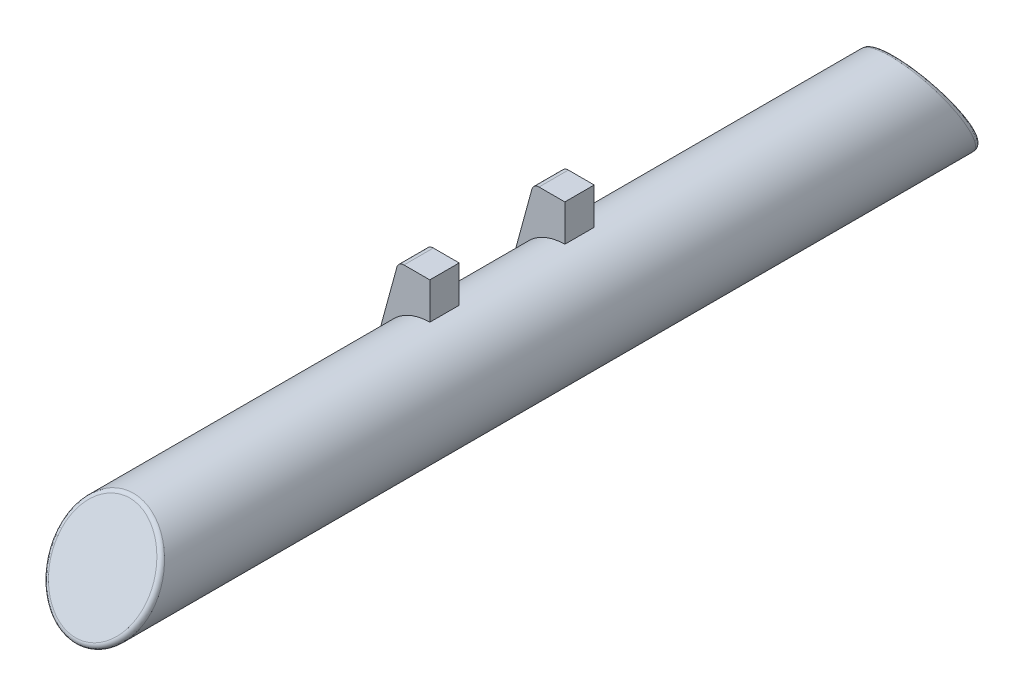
ISO-10303-21;
HEADER;
FILE_DESCRIPTION(('STEP AP214'),'2;1');
FILE_NAME('part.step','',(''),(''),'','','');
FILE_SCHEMA(('AUTOMOTIVE_DESIGN { 1 0 10303 214 1 1 1 1 }'));
ENDSEC;
DATA;
#1=APPLICATION_CONTEXT('core data for automotive mechanical design processes');
#2=APPLICATION_PROTOCOL_DEFINITION('international standard','automotive_design',2000,#1);
#3=PRODUCT_CONTEXT('',#1,'mechanical');
#4=PRODUCT('Part','Part','',(#3));
#5=PRODUCT_RELATED_PRODUCT_CATEGORY('part','',(#4));
#6=PRODUCT_DEFINITION_FORMATION('','',#4);
#7=PRODUCT_DEFINITION_CONTEXT('part definition',#1,'design');
#8=PRODUCT_DEFINITION('design','',#6,#7);
#9=PRODUCT_DEFINITION_SHAPE('','',#8);
#10=(LENGTH_UNIT() NAMED_UNIT(*) SI_UNIT(.MILLI.,.METRE.));
#11=(NAMED_UNIT(*) PLANE_ANGLE_UNIT() SI_UNIT($,.RADIAN.));
#12=(NAMED_UNIT(*) SI_UNIT($,.STERADIAN.) SOLID_ANGLE_UNIT());
#13=UNCERTAINTY_MEASURE_WITH_UNIT(LENGTH_MEASURE(1.E-05),#10,'distance_accuracy_value','');
#14=(GEOMETRIC_REPRESENTATION_CONTEXT(3) GLOBAL_UNCERTAINTY_ASSIGNED_CONTEXT((#13)) GLOBAL_UNIT_ASSIGNED_CONTEXT((#10,
#11,#12)) REPRESENTATION_CONTEXT('',''));
#15=CARTESIAN_POINT('',(0.,0.,0.));
#16=DIRECTION('',(0.,0.,1.));
#17=DIRECTION('',(1.,0.,0.));
#18=AXIS2_PLACEMENT_3D('',#15,#16,#17);
#19=CARTESIAN_POINT('',(0.,0.,60.));
#20=DIRECTION('',(0.,0.,-1.));
#21=DIRECTION('',(-1.,0.,0.));
#22=AXIS2_PLACEMENT_3D('',#19,#20,#21);
#23=CYLINDRICAL_SURFACE('',#22,3.5);
#24=CARTESIAN_POINT('',(0.,0.,35.6));
#25=DIRECTION('',(0.,0.,-1.));
#26=DIRECTION('',(-1.,0.,0.));
#27=AXIS2_PLACEMENT_3D('',#24,#25,#26);
#28=CIRCLE('',#27,3.5);
#29=CARTESIAN_POINT('',(-3.5,0.,35.6));
#30=VERTEX_POINT('',#29);
#31=CARTESIAN_POINT('',(0.,3.5,35.6));
#32=VERTEX_POINT('',#31);
#33=EDGE_CURVE('E206',#30,#32,#28,.T.);
#34=ORIENTED_EDGE('',*,*,#33,.F.);
#35=DIRECTION('',(0.,0.,-1.));
#36=VECTOR('',#35,1.);
#37=CARTESIAN_POINT('',(-3.5,0.,60.));
#38=LINE('',#37,#36);
#39=CARTESIAN_POINT('',(-3.5,0.,33.6));
#40=VERTEX_POINT('',#39);
#41=EDGE_CURVE('E259',#40,#30,#38,.F.);
#42=ORIENTED_EDGE('',*,*,#41,.F.);
#43=CARTESIAN_POINT('',(0.,0.,33.6));
#44=DIRECTION('',(0.,0.,-1.));
#45=DIRECTION('',(-1.,0.,0.));
#46=AXIS2_PLACEMENT_3D('',#43,#44,#45);
#47=CIRCLE('',#46,3.5);
#48=CARTESIAN_POINT('',(0.,3.5,33.6));
#49=VERTEX_POINT('',#48);
#50=EDGE_CURVE('E264',#40,#49,#47,.T.);
#51=ORIENTED_EDGE('',*,*,#50,.T.);
#52=DIRECTION('',(0.,0.,-1.));
#53=VECTOR('',#52,1.);
#54=CARTESIAN_POINT('',(0.,3.5,60.));
#55=LINE('',#54,#53);
#56=EDGE_CURVE('E261',#32,#49,#55,.T.);
#57=ORIENTED_EDGE('',*,*,#56,.F.);
#58=EDGE_LOOP('',(#34,#42,#51,#57));
#59=FACE_BOUND('',#58,.T.);
#60=CARTESIAN_POINT('',(0.,0.,57.6328638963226));
#61=DIRECTION('',(0.,0.466817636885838,0.884353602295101));
#62=DIRECTION('',(0.,0.884353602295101,-0.466817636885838));
#63=AXIS2_PLACEMENT_3D('',#60,#61,#62);
#64=ELLIPSE('',#63,3.95769293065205,3.5);
#65=CARTESIAN_POINT('',(0.,3.5,55.7853430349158));
#66=VERTEX_POINT('',#65);
#67=EDGE_CURVE('E211',#66,#66,#64,.F.);
#68=ORIENTED_EDGE('',*,*,#67,.T.);
#69=EDGE_LOOP('',(#68));
#70=FACE_BOUND('',#69,.T.);
#71=CARTESIAN_POINT('',(0.,0.,2.36713610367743));
#72=DIRECTION('',(0.,0.466817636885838,-0.884353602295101));
#73=DIRECTION('',(0.,-0.884353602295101,-0.466817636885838));
#74=AXIS2_PLACEMENT_3D('',#71,#72,#73);
#75=ELLIPSE('',#74,3.95769293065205,3.5);
#76=CARTESIAN_POINT('',(0.,-3.5,0.519615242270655));
#77=VERTEX_POINT('',#76);
#78=EDGE_CURVE('E169',#77,#77,#75,.F.);
#79=ORIENTED_EDGE('',*,*,#78,.T.);
#80=EDGE_LOOP('',(#79));
#81=FACE_BOUND('',#80,.T.);
#82=CARTESIAN_POINT('',(0.,0.,24.4));
#83=DIRECTION('',(0.,0.,1.));
#84=DIRECTION('',(1.,0.,0.));
#85=AXIS2_PLACEMENT_3D('',#82,#83,#84);
#86=CIRCLE('',#85,3.5);
#87=CARTESIAN_POINT('',(0.,3.5,24.4));
#88=VERTEX_POINT('',#87);
#89=CARTESIAN_POINT('',(-3.5,0.,24.4));
#90=VERTEX_POINT('',#89);
#91=EDGE_CURVE('E217',#88,#90,#86,.T.);
#92=ORIENTED_EDGE('',*,*,#91,.F.);
#93=DIRECTION('',(0.,0.,-1.));
#94=VECTOR('',#93,1.);
#95=CARTESIAN_POINT('',(0.,3.5,60.));
#96=LINE('',#95,#94);
#97=CARTESIAN_POINT('',(0.,3.5,26.4));
#98=VERTEX_POINT('',#97);
#99=EDGE_CURVE('E218',#88,#98,#96,.F.);
#100=ORIENTED_EDGE('',*,*,#99,.T.);
#101=CARTESIAN_POINT('',(0.,0.,26.4));
#102=DIRECTION('',(0.,0.,1.));
#103=DIRECTION('',(1.,0.,0.));
#104=AXIS2_PLACEMENT_3D('',#101,#102,#103);
#105=CIRCLE('',#104,3.5);
#106=CARTESIAN_POINT('',(-3.5,0.,26.4));
#107=VERTEX_POINT('',#106);
#108=EDGE_CURVE('E128',#98,#107,#105,.T.);
#109=ORIENTED_EDGE('',*,*,#108,.T.);
#110=DIRECTION('',(0.,0.,-1.));
#111=VECTOR('',#110,1.);
#112=CARTESIAN_POINT('',(-3.5,0.,60.));
#113=LINE('',#112,#111);
#114=EDGE_CURVE('E220',#107,#90,#113,.T.);
#115=ORIENTED_EDGE('',*,*,#114,.T.);
#116=EDGE_LOOP('',(#92,#100,#109,#115));
#117=FACE_BOUND('',#116,.T.);
#118=ADVANCED_FACE('F30',(#59,#70,#81,#117),#23,.T.);
#119=CARTESIAN_POINT('',(-5.,-3.5,0.));
#120=DIRECTION('',(0.,-0.499999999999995,0.866025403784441));
#121=DIRECTION('',(0.,-0.866025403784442,-0.499999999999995));
#122=AXIS2_PLACEMENT_3D('',#119,#120,#121);
#123=PLANE('',#122);
#124=CARTESIAN_POINT('',(0.,0.149999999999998,2.1073284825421));
#125=DIRECTION('',(0.,-0.499999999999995,0.866025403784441));
#126=DIRECTION('',(0.,-0.866025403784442,-0.499999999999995));
#127=AXIS2_PLACEMENT_3D('',#124,#125,#126);
#128=ELLIPSE('',#127,3.69504172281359,3.2);
#129=CARTESIAN_POINT('',(0.,-3.05,0.259807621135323));
#130=VERTEX_POINT('',#129);
#131=EDGE_CURVE('E267',#130,#130,#128,.F.);
#132=ORIENTED_EDGE('',*,*,#131,.T.);
#133=EDGE_LOOP('',(#132));
#134=FACE_BOUND('',#133,.T.);
#135=ADVANCED_FACE('F185',(#134),#123,.F.);
#136=CARTESIAN_POINT('',(-5.,-3.5,60.));
#137=DIRECTION('',(0.,-0.499999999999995,-0.866025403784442));
#138=DIRECTION('',(0.,0.866025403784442,-0.499999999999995));
#139=AXIS2_PLACEMENT_3D('',#136,#137,#138);
#140=PLANE('',#139);
#141=CARTESIAN_POINT('',(0.,0.149999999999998,57.8926715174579));
#142=DIRECTION('',(0.,-0.499999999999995,-0.866025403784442));
#143=DIRECTION('',(0.,0.866025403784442,-0.499999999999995));
#144=AXIS2_PLACEMENT_3D('',#141,#142,#143);
#145=ELLIPSE('',#144,3.69504172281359,3.2);
#146=CARTESIAN_POINT('',(0.,3.35,56.0451506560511));
#147=VERTEX_POINT('',#146);
#148=EDGE_CURVE('E270',#147,#147,#145,.F.);
#149=ORIENTED_EDGE('',*,*,#148,.T.);
#150=EDGE_LOOP('',(#149));
#151=FACE_BOUND('',#150,.T.);
#152=ADVANCED_FACE('F188',(#151),#140,.F.);
#153=CARTESIAN_POINT('',(0.,3.35,56.0451506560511));
#154=CARTESIAN_POINT('',(0.,3.41961524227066,56.0049582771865));
#155=CARTESIAN_POINT('',(0.,3.45980762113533,55.9353430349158));
#156=CARTESIAN_POINT('',(0.,3.5,55.8657277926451));
#157=CARTESIAN_POINT('',(0.,3.5,55.7853430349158));
#158=CARTESIAN_POINT('',(0.139757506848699,3.35,56.0451506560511));
#159=CARTESIAN_POINT('',(0.143811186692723,3.41961524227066,56.0049582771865));
#160=CARTESIAN_POINT('',(0.14732214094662,3.45980762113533,55.9353430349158));
#161=CARTESIAN_POINT('',(0.150832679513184,3.5,55.8657277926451));
#162=CARTESIAN_POINT('',(0.152859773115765,3.5,55.7853430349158));
#163=CARTESIAN_POINT('',(0.279515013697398,3.34081332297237,56.050454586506));
#164=CARTESIAN_POINT('',(0.287654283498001,3.41027364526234,56.0103516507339));
#165=CARTESIAN_POINT('',(0.29464428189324,3.45024845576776,55.9407185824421));
#166=CARTESIAN_POINT('',(0.301698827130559,3.49021479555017,55.8710902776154));
#167=CARTESIAN_POINT('',(0.305719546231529,3.48995207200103,55.7906469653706));
#168=CARTESIAN_POINT('',(0.556627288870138,3.30433180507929,56.071517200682));
#169=CARTESIAN_POINT('',(0.572855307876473,3.37318980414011,56.0317620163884));
#170=CARTESIAN_POINT('',(0.586820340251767,3.41228242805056,55.9620674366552));
#171=CARTESIAN_POINT('',(0.600849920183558,3.45136674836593,55.8923775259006));
#172=CARTESIAN_POINT('',(0.608811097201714,3.45005041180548,55.8117095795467));
#173=CARTESIAN_POINT('',(0.69396419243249,3.27693572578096,56.0873343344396));
#174=CARTESIAN_POINT('',(0.714256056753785,3.34532833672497,56.0478478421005));
#175=CARTESIAN_POINT('',(0.731655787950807,3.38377019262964,55.9780999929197));
#176=CARTESIAN_POINT('',(0.749179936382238,3.42217900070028,55.9083707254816));
#177=CARTESIAN_POINT('',(0.759023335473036,3.42008595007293,55.8275267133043));
#178=CARTESIAN_POINT('',(0.963912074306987,3.20460523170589,56.1290943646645));
#179=CARTESIAN_POINT('',(0.992236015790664,3.27178887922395,56.0903058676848));
#180=CARTESIAN_POINT('',(1.01647056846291,3.30847529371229,56.0204348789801));
#181=CARTESIAN_POINT('',(1.04083178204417,3.34512838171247,55.9505826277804));
#182=CARTESIAN_POINT('',(1.05427883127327,3.34097447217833,55.8692867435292));
#183=CARTESIAN_POINT('',(1.09645688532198,3.15948656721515,56.1551436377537));
#184=CARTESIAN_POINT('',(1.12880082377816,3.22589240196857,56.1168042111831));
#185=CARTESIAN_POINT('',(1.15638148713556,3.26150068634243,56.0468450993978));
#186=CARTESIAN_POINT('',(1.18413908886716,3.29703649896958,55.9769267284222));
#187=CARTESIAN_POINT('',(1.19924971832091,3.29162593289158,55.8953360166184));
#188=CARTESIAN_POINT('',(1.35460848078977,3.05255901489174,56.2168782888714));
#189=CARTESIAN_POINT('',(1.39488723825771,3.11714076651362,56.1795919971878));
#190=CARTESIAN_POINT('',(1.42907033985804,3.15013809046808,56.1094479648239));
#191=CARTESIAN_POINT('',(1.46343561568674,3.18306123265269,56.0393456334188));
#192=CARTESIAN_POINT('',(1.48160302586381,3.17467392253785,55.9570706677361));
#193=CARTESIAN_POINT('',(1.48008396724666,2.99051358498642,56.2527002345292));
#194=CARTESIAN_POINT('',(1.52431588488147,3.05400164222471,56.2160453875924));
#195=CARTESIAN_POINT('',(1.56171249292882,3.08550328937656,56.1457792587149));
#196=CARTESIAN_POINT('',(1.5993284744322,3.1168799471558,56.0755833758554));
#197=CARTESIAN_POINT('',(1.61884183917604,3.1068117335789,55.9928926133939));
#198=CARTESIAN_POINT('',(1.72201850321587,2.8508351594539,56.3333436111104));
#199=CARTESIAN_POINT('',(1.77404316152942,2.91187165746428,56.2981041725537));
#200=CARTESIAN_POINT('',(1.8177194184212,2.93993318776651,56.2275912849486));
#201=CARTESIAN_POINT('',(1.86162319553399,2.96786560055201,56.1571509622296));
#202=CARTESIAN_POINT('',(1.88345773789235,2.9540384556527,56.0735359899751));
#203=CARTESIAN_POINT('',(1.83828089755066,2.77294794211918,56.378311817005));
#204=CARTESIAN_POINT('',(1.89416722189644,2.83256973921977,56.3438891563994));
#205=CARTESIAN_POINT('',(1.94088075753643,2.85873196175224,56.2732212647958));
#206=CARTESIAN_POINT('',(1.98784362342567,2.88470578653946,56.2026592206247));
#207=CARTESIAN_POINT('',(2.01061973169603,2.86884931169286,56.1185041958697));
#208=CARTESIAN_POINT('',(2.05986385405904,2.60292385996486,56.4764752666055));
#209=CARTESIAN_POINT('',(2.12334999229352,2.65945078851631,56.4438394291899));
#210=CARTESIAN_POINT('',(2.17593217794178,2.68137860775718,56.3728631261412));
#211=CARTESIAN_POINT('',(2.22877393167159,2.70311085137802,56.3019967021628));
#212=CARTESIAN_POINT('',(2.25297609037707,2.68288547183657,56.2166676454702));
#213=CARTESIAN_POINT('',(2.16493647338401,2.51054578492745,56.5298097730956));
#214=CARTESIAN_POINT('',(2.23216541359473,2.56533016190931,56.4981799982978));
#215=CARTESIAN_POINT('',(2.28756564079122,2.58497321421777,56.427016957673));
#216=CARTESIAN_POINT('',(2.34323065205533,2.60435621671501,56.3559999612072));
#217=CARTESIAN_POINT('',(2.36789926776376,2.58184695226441,56.2700021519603));
#218=CARTESIAN_POINT('',(2.36238798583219,2.31309657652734,56.6438071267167));
#219=CARTESIAN_POINT('',(2.4369649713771,2.36412400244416,56.6143464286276));
#220=CARTESIAN_POINT('',(2.49773717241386,2.3787817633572,56.5428138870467));
#221=CARTESIAN_POINT('',(2.55878520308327,2.39316920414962,56.4714331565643));
#222=CARTESIAN_POINT('',(2.58386185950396,2.36588688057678,56.3839995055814));
#223=CARTESIAN_POINT('',(2.45449070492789,2.20781924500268,56.704589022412));
#224=CARTESIAN_POINT('',(2.5326602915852,2.25676785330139,56.6763285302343));
#225=CARTESIAN_POINT('',(2.59598918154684,2.26877799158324,56.6045787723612));
#226=CARTESIAN_POINT('',(2.65958222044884,2.28045127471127,56.5330181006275));
#227=CARTESIAN_POINT('',(2.68459920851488,2.25073979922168,56.4447814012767));
#228=CARTESIAN_POINT('',(2.62444722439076,1.98632963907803,56.8324661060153));
#229=CARTESIAN_POINT('',(2.70964402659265,2.03083825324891,56.8067690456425));
#230=CARTESIAN_POINT('',(2.77776540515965,2.03716433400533,56.7345897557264));
#231=CARTESIAN_POINT('',(2.84616138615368,2.04314081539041,56.6626067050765));
#232=CARTESIAN_POINT('',(2.87048915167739,2.0084855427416,56.57265848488));
#233=CARTESIAN_POINT('',(2.70202297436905,1.86995804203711,56.8996532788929));
#234=CARTESIAN_POINT('',(2.79062545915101,1.91204198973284,56.8753561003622));
#235=CARTESIAN_POINT('',(2.86100128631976,1.91538481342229,56.802930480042));
#236=CARTESIAN_POINT('',(2.93162350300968,1.91831233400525,56.7307378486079));
#237=CARTESIAN_POINT('',(2.95533762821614,1.88120410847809,56.6398456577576));
#238=CARTESIAN_POINT('',(2.84159205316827,1.62821908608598,57.0392213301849));
#239=CARTESIAN_POINT('',(2.93681908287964,1.66515795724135,57.0178946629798));
#240=CARTESIAN_POINT('',(3.0113283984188,1.66217916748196,56.9449811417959));
#241=CARTESIAN_POINT('',(3.08609277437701,1.65877106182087,56.8723084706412));
#242=CARTESIAN_POINT('',(3.1079913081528,1.61680212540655,56.7794137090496));
#243=CARTESIAN_POINT('',(2.90333067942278,1.50274190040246,57.1116656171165));
#244=CARTESIAN_POINT('',(3.00173283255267,1.53690022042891,57.0919443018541));
#245=CARTESIAN_POINT('',(3.07815507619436,1.5306345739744,57.0187568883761));
#246=CARTESIAN_POINT('',(3.15478847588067,1.52387740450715,56.9458450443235));
#247=CARTESIAN_POINT('',(3.17551793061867,1.4795614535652,56.8518579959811));
#248=CARTESIAN_POINT('',(3.01013838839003,1.24488683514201,57.2605383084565));
#249=CARTESIAN_POINT('',(3.11466486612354,1.273173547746,57.2442069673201));
#250=CARTESIAN_POINT('',(3.19448595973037,1.26001954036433,57.1704756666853));
#251=CARTESIAN_POINT('',(3.27452436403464,1.24636033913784,57.0970276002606));
#252=CARTESIAN_POINT('',(3.29233886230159,1.19753247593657,57.0007306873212));
#253=CARTESIAN_POINT('',(3.05499750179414,1.11244399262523,57.3370042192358));
#254=CARTESIAN_POINT('',(3.16241633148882,1.13758488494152,57.3224891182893));
#255=CARTESIAN_POINT('',(3.2437715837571,1.12087748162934,57.2484582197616));
#256=CARTESIAN_POINT('',(3.32528576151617,1.10360869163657,57.1747418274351));
#257=CARTESIAN_POINT('',(3.34140351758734,1.05267311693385,57.0771965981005));
#258=CARTESIAN_POINT('',(3.12722771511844,0.842878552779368,57.492637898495));
#259=CARTESIAN_POINT('',(3.24015412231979,0.861402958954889,57.481942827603));
#260=CARTESIAN_POINT('',(3.32410261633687,0.837321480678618,57.4073153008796));
#261=CARTESIAN_POINT('',(3.40821354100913,0.812667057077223,57.3330087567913));
#262=CARTESIAN_POINT('',(3.42040531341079,0.757835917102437,57.2328302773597));
#263=CARTESIAN_POINT('',(3.15444985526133,0.705726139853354,57.5718228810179));
#264=CARTESIAN_POINT('',(3.26992334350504,0.72073233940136,57.5631590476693));
#265=CARTESIAN_POINT('',(3.35499248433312,0.692873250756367,57.4882085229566));
#266=CARTESIAN_POINT('',(3.44015276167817,0.664393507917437,57.4136054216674));
#267=CARTESIAN_POINT('',(3.45017952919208,0.607825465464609,57.3120152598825));
#268=CARTESIAN_POINT('',(3.19087457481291,0.42905421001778,57.7315594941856));
#269=CARTESIAN_POINT('',(3.31109992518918,0.43668751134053,57.7271524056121));
#270=CARTESIAN_POINT('',(3.39789144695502,0.401060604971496,57.651556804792));
#271=CARTESIAN_POINT('',(3.48477546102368,0.364805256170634,57.5763129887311));
#272=CARTESIAN_POINT('',(3.49001906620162,0.305215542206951,57.4717518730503));
#273=CARTESIAN_POINT('',(3.2,0.289527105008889,57.8121155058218));
#274=CARTESIAN_POINT('',(3.32235268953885,0.293267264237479,57.8099561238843));
#275=CARTESIAN_POINT('',(3.40981965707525,0.253686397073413,57.7340170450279));
#276=CARTESIAN_POINT('',(3.49729693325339,0.213440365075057,57.6584499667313));
#277=CARTESIAN_POINT('',(3.5,0.152607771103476,57.5523078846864));
#278=CARTESIAN_POINT('',(3.2,0.0104728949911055,57.973227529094));
#279=CARTESIAN_POINT('',(3.32618409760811,0.00608439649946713,57.9757612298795));
#280=CARTESIAN_POINT('',(3.41444441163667,-0.0415543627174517,57.8991342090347));
#281=CARTESIAN_POINT('',(3.50271529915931,-0.0898610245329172,57.8228807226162));
#282=CARTESIAN_POINT('',(3.5,-0.152607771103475,57.7134199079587));
#283=CARTESIAN_POINT('',(3.19087457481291,-0.129054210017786,58.0537835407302));
#284=CARTESIAN_POINT('',(3.31867838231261,-0.137705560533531,58.0587784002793));
#285=CARTESIAN_POINT('',(3.40714095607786,-0.189420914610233,57.9817911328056));
#286=CARTESIAN_POINT('',(3.49552366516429,-0.241827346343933,57.9051899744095));
#287=CARTESIAN_POINT('',(3.49001906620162,-0.305215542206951,57.7939759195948));
#288=CARTESIAN_POINT('',(3.15444985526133,-0.40572613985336,58.2135201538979));
#289=CARTESIAN_POINT('',(3.2849715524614,-0.423241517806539,58.2236326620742));
#290=CARTESIAN_POINT('',(3.37324908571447,-0.483188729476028,58.1459217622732));
#291=CARTESIAN_POINT('',(3.46144736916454,-0.543824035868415,58.0685953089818));
#292=CARTESIAN_POINT('',(3.45017952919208,-0.607825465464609,57.9537125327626));
#293=CARTESIAN_POINT('',(3.12722771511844,-0.542878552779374,58.2927051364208));
#294=CARTESIAN_POINT('',(3.25875937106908,-0.565009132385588,58.3054822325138));
#295=CARTESIAN_POINT('',(3.34674249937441,-0.629095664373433,58.2273989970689));
#296=CARTESIAN_POINT('',(3.43455116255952,-0.693877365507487,58.1497037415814));
#297=CARTESIAN_POINT('',(3.42040531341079,-0.757835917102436,58.0328975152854));
#298=CARTESIAN_POINT('',(3.05499750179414,-0.812443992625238,58.44833881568));
#299=CARTESIAN_POINT('',(3.1879114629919,-0.844123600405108,58.4666290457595));
#300=CARTESIAN_POINT('',(3.27469283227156,-0.916486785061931,58.387795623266));
#301=CARTESIAN_POINT('',(3.36130226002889,-0.989536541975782,58.3093453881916));
#302=CARTESIAN_POINT('',(3.34140351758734,-1.05267311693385,58.1885311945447));
#303=CARTESIAN_POINT('',(3.01013838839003,-0.944886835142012,58.5248047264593));
#304=CARTESIAN_POINT('',(3.14333666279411,-0.98149877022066,58.5459426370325));
#305=CARTESIAN_POINT('',(3.22930900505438,-1.05799756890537,58.4667305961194));
#306=CARTESIAN_POINT('',(3.31501397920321,-1.13517156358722,58.3878949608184));
#307=CARTESIAN_POINT('',(3.29233886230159,-1.19753247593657,58.264997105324));
#308=CARTESIAN_POINT('',(2.90333067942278,-1.20274190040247,58.6736774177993));
#309=CARTESIAN_POINT('',(3.03632756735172,-1.24949427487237,58.7006699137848));
#310=CARTESIAN_POINT('',(3.12005685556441,-1.33417196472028,58.6206926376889));
#311=CARTESIAN_POINT('',(3.20352455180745,-1.41951159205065,58.5410843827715));
#312=CARTESIAN_POINT('',(3.17551793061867,-1.47956145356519,58.413869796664));
#313=CARTESIAN_POINT('',(2.84159205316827,-1.32821908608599,58.7461217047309));
#314=CARTESIAN_POINT('',(2.97402069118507,-1.38016067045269,58.7761101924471));
#315=CARTESIAN_POINT('',(3.05641519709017,-1.46889706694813,58.695755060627));
#316=CARTESIAN_POINT('',(3.13845832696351,-1.55826378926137,58.6157509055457));
#317=CARTESIAN_POINT('',(3.1079913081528,-1.61680212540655,58.4863140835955));
#318=CARTESIAN_POINT('',(2.70202297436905,-1.56995804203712,58.8856897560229));
#319=CARTESIAN_POINT('',(2.83240152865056,-1.63247869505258,58.9217860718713));
#320=CARTESIAN_POINT('',(2.91150418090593,-1.72914052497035,58.8406649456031));
#321=CARTESIAN_POINT('',(2.99026525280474,-1.82641649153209,58.7598857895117));
#322=CARTESIAN_POINT('',(2.95533762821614,-1.88120410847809,58.6258821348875));
#323=CARTESIAN_POINT('',(2.62444722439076,-1.68632963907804,58.9528769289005));
#324=CARTESIAN_POINT('',(2.75327346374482,-1.75420287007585,58.9920635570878));
#325=CARTESIAN_POINT('',(2.83051294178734,-1.8547665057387,58.910573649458));
#326=CARTESIAN_POINT('',(2.90733388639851,-1.95589176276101,58.8293960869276));
#327=CARTESIAN_POINT('',(2.87048915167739,-2.0084855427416,58.6930693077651));
#328=CARTESIAN_POINT('',(2.45449070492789,-1.90781924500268,59.0807540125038));
#329=CARTESIAN_POINT('',(2.57915482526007,-1.98648096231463,59.1261693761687));
#330=CARTESIAN_POINT('',(2.65206709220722,-2.09454895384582,59.0439301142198));
#331=CARTESIAN_POINT('',(2.72457450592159,-2.20316172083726,58.9619938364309));
#332=CARTESIAN_POINT('',(2.68459920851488,-2.25073979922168,58.8209463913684));
#333=CARTESIAN_POINT('',(2.36238798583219,-2.01309657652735,59.1415359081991));
#334=CARTESIAN_POINT('',(2.48439144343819,-2.09713917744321,59.1900579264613));
#335=CARTESIAN_POINT('',(2.5549201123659,-2.20886571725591,59.1074684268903));
#336=CARTESIAN_POINT('',(2.62498806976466,-2.32106478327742,59.0251414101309));
#337=CARTESIAN_POINT('',(2.58386185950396,-2.36588688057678,58.8817282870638));
#338=CARTESIAN_POINT('',(2.16493647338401,-2.21054578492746,59.2555332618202));
#339=CARTESIAN_POINT('',(2.28043538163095,-2.30526563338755,59.3102197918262));
#340=CARTESIAN_POINT('',(2.34564013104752,-2.42389861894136,59.2269181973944));
#341=CARTESIAN_POINT('',(2.41040050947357,-2.54298902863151,59.1438707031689));
#342=CARTESIAN_POINT('',(2.36789926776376,-2.58184695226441,58.9957256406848));
#343=CARTESIAN_POINT('',(2.05986385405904,-2.30292385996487,59.3088677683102));
#344=CARTESIAN_POINT('',(2.17149532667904,-2.40287023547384,59.3665718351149));
#345=CARTESIAN_POINT('',(2.23381717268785,-2.52482701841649,59.2829488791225));
#346=CARTESIAN_POINT('',(2.29566847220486,-2.64715303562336,59.1995307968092));
#347=CARTESIAN_POINT('',(2.25297609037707,-2.68288547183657,59.0490601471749));
#348=CARTESIAN_POINT('',(1.83828089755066,-2.47294794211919,59.4070312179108));
#349=CARTESIAN_POINT('',(1.94091362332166,-2.58304165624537,59.4705938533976));
#350=CARTESIAN_POINT('',(1.99698292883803,-2.71112572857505,59.3863196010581));
#351=CARTESIAN_POINT('',(2.05259845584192,-2.83956764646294,59.3022439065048));
#352=CARTESIAN_POINT('',(2.01061973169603,-2.86884931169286,59.1472235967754));
#353=CARTESIAN_POINT('',(1.72201850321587,-2.5508351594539,59.4519994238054));
#354=CARTESIAN_POINT('',(1.81953013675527,-2.6657706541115,59.5183574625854));
#355=CARTESIAN_POINT('',(1.87225433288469,-2.79674961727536,59.433801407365));
#356=CARTESIAN_POINT('',(1.92453577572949,-2.92798931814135,59.3493898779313));
#357=CARTESIAN_POINT('',(1.88345773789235,-2.9540384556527,59.1921918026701));
#358=CARTESIAN_POINT('',(1.48008396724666,-2.69051358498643,59.5326428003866));
#359=CARTESIAN_POINT('',(1.56608689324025,-2.81456046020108,59.6042612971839));
#360=CARTESIAN_POINT('',(1.61173091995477,-2.95070928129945,59.5191402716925));
#361=CARTESIAN_POINT('',(1.65694661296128,-3.08711213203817,59.4341600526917));
#362=CARTESIAN_POINT('',(1.61884183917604,-3.1068117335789,59.2728351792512));
#363=CARTESIAN_POINT('',(1.35460848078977,-2.75255901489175,59.5684647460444));
#364=CARTESIAN_POINT('',(1.43427134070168,-2.88079534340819,59.6425020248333));
#365=CARTESIAN_POINT('',(1.47616381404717,-3.01931752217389,59.557149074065));
#366=CARTESIAN_POINT('',(1.51768061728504,-3.15799798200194,59.4718837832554));
#367=CARTESIAN_POINT('',(1.48160302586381,-3.17467392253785,59.3086571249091));
#368=CARTESIAN_POINT('',(1.09645688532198,-2.85948656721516,59.6301993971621));
#369=CARTESIAN_POINT('',(1.16227996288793,-2.99524164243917,59.7085776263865));
#370=CARTESIAN_POINT('',(1.19640018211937,-3.13781101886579,59.6227718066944));
#371=CARTESIAN_POINT('',(1.23015434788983,-3.28053626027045,59.5370523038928));
#372=CARTESIAN_POINT('',(1.19924971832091,-3.29162593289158,59.3703917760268));
#373=CARTESIAN_POINT('',(0.963912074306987,-2.9046052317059,59.6562486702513));
#374=CARTESIAN_POINT('',(1.02231951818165,-3.04361785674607,59.736507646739));
#375=CARTESIAN_POINT('',(1.05235787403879,-3.18795411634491,59.650528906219));
#376=CARTESIAN_POINT('',(1.08212361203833,-3.33236437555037,59.5645911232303));
#377=CARTESIAN_POINT('',(1.05427883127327,-3.34097447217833,59.396441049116));
#378=CARTESIAN_POINT('',(0.693964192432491,-2.97693572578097,59.6980087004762));
#379=CARTESIAN_POINT('',(0.736614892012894,-3.12133374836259,59.7813769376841));
#380=CARTESIAN_POINT('',(0.758357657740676,-3.26845447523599,59.6950808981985));
#381=CARTESIAN_POINT('',(0.779831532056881,-3.41564946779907,59.6088259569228));
#382=CARTESIAN_POINT('',(0.759023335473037,-3.42008595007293,59.4382010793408));
#383=CARTESIAN_POINT('',(0.55662728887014,-3.0043318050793,59.7138258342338));
#384=CARTESIAN_POINT('',(0.591051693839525,-3.15080364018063,59.7983913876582));
#385=CARTESIAN_POINT('',(0.608478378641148,-3.29901528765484,59.7119885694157));
#386=CARTESIAN_POINT('',(0.625762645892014,-3.44724573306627,59.6255961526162));
#387=CARTESIAN_POINT('',(0.608811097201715,-3.45005041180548,59.4540182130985));
#388=CARTESIAN_POINT('',(0.279515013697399,-3.04081332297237,59.7348884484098));
#389=CARTESIAN_POINT('',(0.296913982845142,-3.19010065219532,59.8210795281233));
#390=CARTESIAN_POINT('',(0.305718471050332,-3.33973164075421,59.7345130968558));
#391=CARTESIAN_POINT('',(0.314379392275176,-3.48938229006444,59.6479575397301));
#392=CARTESIAN_POINT('',(0.305719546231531,-3.48995207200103,59.4750808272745));
#393=CARTESIAN_POINT('',(0.1397575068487,-3.05,59.7401923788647));
#394=CARTESIAN_POINT('',(0.148492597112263,-3.2,59.8267949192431));
#395=CARTESIAN_POINT('',(0.152859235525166,-3.35,59.7401923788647));
#396=CARTESIAN_POINT('',(0.157227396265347,-3.5,59.6535898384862));
#397=CARTESIAN_POINT('',(0.152859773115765,-3.5,59.4803847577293));
#398=CARTESIAN_POINT('',(-0.139757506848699,-3.05,59.7401923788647));
#399=CARTESIAN_POINT('',(-0.148492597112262,-3.2,59.8267949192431));
#400=CARTESIAN_POINT('',(-0.152859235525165,-3.35,59.7401923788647));
#401=CARTESIAN_POINT('',(-0.157227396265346,-3.5,59.6535898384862));
#402=CARTESIAN_POINT('',(-0.152859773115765,-3.5,59.4803847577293));
#403=CARTESIAN_POINT('',(-0.279515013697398,-3.04081332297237,59.7348884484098));
#404=CARTESIAN_POINT('',(-0.296913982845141,-3.19010065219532,59.8210795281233));
#405=CARTESIAN_POINT('',(-0.305718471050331,-3.33973164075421,59.7345130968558));
#406=CARTESIAN_POINT('',(-0.314379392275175,-3.48938229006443,59.6479575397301));
#407=CARTESIAN_POINT('',(-0.30571954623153,-3.48995207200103,59.4750808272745));
#408=CARTESIAN_POINT('',(-0.556627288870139,-3.0043318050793,59.7138258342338));
#409=CARTESIAN_POINT('',(-0.591051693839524,-3.15080364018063,59.7983913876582));
#410=CARTESIAN_POINT('',(-0.608478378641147,-3.29901528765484,59.7119885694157));
#411=CARTESIAN_POINT('',(-0.625762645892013,-3.44724573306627,59.6255961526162));
#412=CARTESIAN_POINT('',(-0.608811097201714,-3.45005041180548,59.4540182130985));
#413=CARTESIAN_POINT('',(-0.69396419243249,-2.97693572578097,59.6980087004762));
#414=CARTESIAN_POINT('',(-0.736614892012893,-3.12133374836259,59.7813769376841));
#415=CARTESIAN_POINT('',(-0.758357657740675,-3.26845447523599,59.6950808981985));
#416=CARTESIAN_POINT('',(-0.77983153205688,-3.41564946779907,59.6088259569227));
#417=CARTESIAN_POINT('',(-0.759023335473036,-3.42008595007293,59.4382010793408));
#418=CARTESIAN_POINT('',(-0.963912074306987,-2.9046052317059,59.6562486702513));
#419=CARTESIAN_POINT('',(-1.02231951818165,-3.04361785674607,59.736507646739));
#420=CARTESIAN_POINT('',(-1.05235787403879,-3.18795411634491,59.650528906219));
#421=CARTESIAN_POINT('',(-1.08212361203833,-3.33236437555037,59.5645911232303));
#422=CARTESIAN_POINT('',(-1.05427883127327,-3.34097447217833,59.396441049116));
#423=CARTESIAN_POINT('',(-1.09645688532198,-2.85948656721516,59.6301993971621));
#424=CARTESIAN_POINT('',(-1.16227996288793,-2.99524164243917,59.7085776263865));
#425=CARTESIAN_POINT('',(-1.19640018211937,-3.13781101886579,59.6227718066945));
#426=CARTESIAN_POINT('',(-1.23015434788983,-3.28053626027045,59.5370523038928));
#427=CARTESIAN_POINT('',(-1.19924971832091,-3.29162593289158,59.3703917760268));
#428=CARTESIAN_POINT('',(-1.35460848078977,-2.75255901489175,59.5684647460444));
#429=CARTESIAN_POINT('',(-1.43427134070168,-2.88079534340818,59.6425020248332));
#430=CARTESIAN_POINT('',(-1.47616381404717,-3.01931752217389,59.557149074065));
#431=CARTESIAN_POINT('',(-1.51768061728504,-3.15799798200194,59.4718837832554));
#432=CARTESIAN_POINT('',(-1.48160302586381,-3.17467392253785,59.3086571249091));
#433=CARTESIAN_POINT('',(-1.48008396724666,-2.69051358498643,59.5326428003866));
#434=CARTESIAN_POINT('',(-1.56608689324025,-2.81456046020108,59.6042612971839));
#435=CARTESIAN_POINT('',(-1.61173091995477,-2.95070928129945,59.5191402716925));
#436=CARTESIAN_POINT('',(-1.65694661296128,-3.08711213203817,59.4341600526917));
#437=CARTESIAN_POINT('',(-1.61884183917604,-3.1068117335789,59.2728351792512));
#438=CARTESIAN_POINT('',(-1.72201850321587,-2.5508351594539,59.4519994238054));
#439=CARTESIAN_POINT('',(-1.81953013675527,-2.6657706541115,59.5183574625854));
#440=CARTESIAN_POINT('',(-1.87225433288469,-2.79674961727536,59.433801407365));
#441=CARTESIAN_POINT('',(-1.92453577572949,-2.92798931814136,59.3493898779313));
#442=CARTESIAN_POINT('',(-1.88345773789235,-2.9540384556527,59.1921918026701));
#443=CARTESIAN_POINT('',(-1.83828089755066,-2.47294794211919,59.4070312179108));
#444=CARTESIAN_POINT('',(-1.94091362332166,-2.58304165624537,59.4705938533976));
#445=CARTESIAN_POINT('',(-1.99698292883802,-2.71112572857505,59.3863196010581));
#446=CARTESIAN_POINT('',(-2.05259845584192,-2.83956764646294,59.3022439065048));
#447=CARTESIAN_POINT('',(-2.01061973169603,-2.86884931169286,59.1472235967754));
#448=CARTESIAN_POINT('',(-2.05986385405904,-2.30292385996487,59.3088677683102));
#449=CARTESIAN_POINT('',(-2.17149532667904,-2.40287023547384,59.3665718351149));
#450=CARTESIAN_POINT('',(-2.23381717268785,-2.52482701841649,59.2829488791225));
#451=CARTESIAN_POINT('',(-2.29566847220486,-2.64715303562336,59.1995307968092));
#452=CARTESIAN_POINT('',(-2.25297609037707,-2.68288547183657,59.0490601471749));
#453=CARTESIAN_POINT('',(-2.16493647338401,-2.21054578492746,59.2555332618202));
#454=CARTESIAN_POINT('',(-2.28043538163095,-2.30526563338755,59.3102197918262));
#455=CARTESIAN_POINT('',(-2.34564013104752,-2.42389861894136,59.2269181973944));
#456=CARTESIAN_POINT('',(-2.41040050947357,-2.5429890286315,59.1438707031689));
#457=CARTESIAN_POINT('',(-2.36789926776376,-2.58184695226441,58.9957256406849));
#458=CARTESIAN_POINT('',(-2.36238798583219,-2.01309657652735,59.1415359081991));
#459=CARTESIAN_POINT('',(-2.48439144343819,-2.09713917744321,59.1900579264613));
#460=CARTESIAN_POINT('',(-2.5549201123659,-2.20886571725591,59.1074684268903));
#461=CARTESIAN_POINT('',(-2.62498806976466,-2.32106478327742,59.0251414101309));
#462=CARTESIAN_POINT('',(-2.58386185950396,-2.36588688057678,58.8817282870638));
#463=CARTESIAN_POINT('',(-2.45449070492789,-1.90781924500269,59.0807540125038));
#464=CARTESIAN_POINT('',(-2.57915482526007,-1.98648096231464,59.1261693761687));
#465=CARTESIAN_POINT('',(-2.65206709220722,-2.09454895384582,59.0439301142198));
#466=CARTESIAN_POINT('',(-2.72457450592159,-2.20316172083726,58.9619938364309));
#467=CARTESIAN_POINT('',(-2.68459920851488,-2.25073979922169,58.8209463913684));
#468=CARTESIAN_POINT('',(-2.62444722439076,-1.68632963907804,58.9528769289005));
#469=CARTESIAN_POINT('',(-2.75327346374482,-1.75420287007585,58.9920635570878));
#470=CARTESIAN_POINT('',(-2.83051294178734,-1.85476650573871,58.910573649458));
#471=CARTESIAN_POINT('',(-2.90733388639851,-1.95589176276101,58.8293960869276));
#472=CARTESIAN_POINT('',(-2.87048915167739,-2.00848554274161,58.6930693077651));
#473=CARTESIAN_POINT('',(-2.70202297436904,-1.56995804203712,58.8856897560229));
#474=CARTESIAN_POINT('',(-2.83240152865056,-1.63247869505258,58.9217860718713));
#475=CARTESIAN_POINT('',(-2.91150418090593,-1.72914052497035,58.8406649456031));
#476=CARTESIAN_POINT('',(-2.99026525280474,-1.82641649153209,58.7598857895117));
#477=CARTESIAN_POINT('',(-2.95533762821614,-1.88120410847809,58.6258821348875));
#478=CARTESIAN_POINT('',(-2.84159205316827,-1.32821908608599,58.7461217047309));
#479=CARTESIAN_POINT('',(-2.97402069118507,-1.38016067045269,58.7761101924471));
#480=CARTESIAN_POINT('',(-3.05641519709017,-1.46889706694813,58.695755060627));
#481=CARTESIAN_POINT('',(-3.13845832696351,-1.55826378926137,58.6157509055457));
#482=CARTESIAN_POINT('',(-3.1079913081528,-1.61680212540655,58.4863140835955));
#483=CARTESIAN_POINT('',(-2.90333067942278,-1.20274190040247,58.6736774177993));
#484=CARTESIAN_POINT('',(-3.03632756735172,-1.24949427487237,58.7006699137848));
#485=CARTESIAN_POINT('',(-3.12005685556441,-1.33417196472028,58.6206926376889));
#486=CARTESIAN_POINT('',(-3.20352455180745,-1.41951159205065,58.5410843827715));
#487=CARTESIAN_POINT('',(-3.17551793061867,-1.47956145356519,58.413869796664));
#488=CARTESIAN_POINT('',(-3.01013838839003,-0.944886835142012,58.5248047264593));
#489=CARTESIAN_POINT('',(-3.14333666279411,-0.981498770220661,58.5459426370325));
#490=CARTESIAN_POINT('',(-3.22930900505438,-1.05799756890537,58.4667305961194));
#491=CARTESIAN_POINT('',(-3.31501397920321,-1.13517156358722,58.3878949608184));
#492=CARTESIAN_POINT('',(-3.29233886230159,-1.19753247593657,58.264997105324));
#493=CARTESIAN_POINT('',(-3.05499750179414,-0.812443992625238,58.44833881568));
#494=CARTESIAN_POINT('',(-3.1879114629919,-0.844123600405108,58.4666290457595));
#495=CARTESIAN_POINT('',(-3.27469283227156,-0.916486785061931,58.387795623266));
#496=CARTESIAN_POINT('',(-3.36130226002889,-0.989536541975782,58.3093453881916));
#497=CARTESIAN_POINT('',(-3.34140351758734,-1.05267311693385,58.1885311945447));
#498=CARTESIAN_POINT('',(-3.12722771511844,-0.542878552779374,58.2927051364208));
#499=CARTESIAN_POINT('',(-3.25875937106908,-0.565009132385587,58.3054822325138));
#500=CARTESIAN_POINT('',(-3.34674249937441,-0.629095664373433,58.2273989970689));
#501=CARTESIAN_POINT('',(-3.43455116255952,-0.693877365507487,58.1497037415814));
#502=CARTESIAN_POINT('',(-3.42040531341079,-0.757835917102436,58.0328975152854));
#503=CARTESIAN_POINT('',(-3.15444985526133,-0.40572613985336,58.2135201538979));
#504=CARTESIAN_POINT('',(-3.2849715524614,-0.423241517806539,58.2236326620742));
#505=CARTESIAN_POINT('',(-3.37324908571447,-0.483188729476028,58.1459217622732));
#506=CARTESIAN_POINT('',(-3.46144736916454,-0.543824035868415,58.0685953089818));
#507=CARTESIAN_POINT('',(-3.45017952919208,-0.607825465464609,57.9537125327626));
#508=CARTESIAN_POINT('',(-3.19087457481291,-0.129054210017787,58.0537835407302));
#509=CARTESIAN_POINT('',(-3.31867838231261,-0.137705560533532,58.0587784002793));
#510=CARTESIAN_POINT('',(-3.40714095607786,-0.189420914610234,57.9817911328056));
#511=CARTESIAN_POINT('',(-3.49552366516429,-0.241827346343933,57.9051899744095));
#512=CARTESIAN_POINT('',(-3.49001906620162,-0.305215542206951,57.7939759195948));
#513=CARTESIAN_POINT('',(-3.2,0.0104728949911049,57.973227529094));
#514=CARTESIAN_POINT('',(-3.32618409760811,0.00608439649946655,57.9757612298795));
#515=CARTESIAN_POINT('',(-3.41444441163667,-0.0415543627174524,57.8991342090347));
#516=CARTESIAN_POINT('',(-3.50271529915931,-0.0898610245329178,57.8228807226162));
#517=CARTESIAN_POINT('',(-3.5,-0.152607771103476,57.7134199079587));
#518=CARTESIAN_POINT('',(-3.2,0.289527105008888,57.8121155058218));
#519=CARTESIAN_POINT('',(-3.32235268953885,0.293267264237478,57.8099561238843));
#520=CARTESIAN_POINT('',(-3.40981965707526,0.253686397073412,57.7340170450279));
#521=CARTESIAN_POINT('',(-3.49729693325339,0.213440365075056,57.6584499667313));
#522=CARTESIAN_POINT('',(-3.5,0.152607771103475,57.5523078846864));
#523=CARTESIAN_POINT('',(-3.19087457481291,0.42905421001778,57.7315594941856));
#524=CARTESIAN_POINT('',(-3.31109992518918,0.436687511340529,57.7271524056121));
#525=CARTESIAN_POINT('',(-3.39789144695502,0.401060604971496,57.651556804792));
#526=CARTESIAN_POINT('',(-3.48477546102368,0.364805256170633,57.5763129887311));
#527=CARTESIAN_POINT('',(-3.49001906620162,0.30521554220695,57.4717518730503));
#528=CARTESIAN_POINT('',(-3.15444985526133,0.705726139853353,57.5718228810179));
#529=CARTESIAN_POINT('',(-3.26992334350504,0.720732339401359,57.5631590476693));
#530=CARTESIAN_POINT('',(-3.35499248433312,0.692873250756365,57.4882085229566));
#531=CARTESIAN_POINT('',(-3.44015276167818,0.664393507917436,57.4136054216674));
#532=CARTESIAN_POINT('',(-3.45017952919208,0.607825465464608,57.3120152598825));
#533=CARTESIAN_POINT('',(-3.12722771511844,0.842878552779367,57.492637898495));
#534=CARTESIAN_POINT('',(-3.24015412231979,0.861402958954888,57.481942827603));
#535=CARTESIAN_POINT('',(-3.32410261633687,0.837321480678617,57.4073153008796));
#536=CARTESIAN_POINT('',(-3.40821354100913,0.812667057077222,57.3330087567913));
#537=CARTESIAN_POINT('',(-3.42040531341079,0.757835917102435,57.2328302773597));
#538=CARTESIAN_POINT('',(-3.05499750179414,1.11244399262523,57.3370042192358));
#539=CARTESIAN_POINT('',(-3.16241633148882,1.13758488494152,57.3224891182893));
#540=CARTESIAN_POINT('',(-3.2437715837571,1.12087748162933,57.2484582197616));
#541=CARTESIAN_POINT('',(-3.32528576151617,1.10360869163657,57.1747418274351));
#542=CARTESIAN_POINT('',(-3.34140351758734,1.05267311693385,57.0771965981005));
#543=CARTESIAN_POINT('',(-3.01013838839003,1.24488683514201,57.2605383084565));
#544=CARTESIAN_POINT('',(-3.11466486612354,1.273173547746,57.2442069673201));
#545=CARTESIAN_POINT('',(-3.19448595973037,1.26001954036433,57.1704756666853));
#546=CARTESIAN_POINT('',(-3.27452436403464,1.24636033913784,57.0970276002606));
#547=CARTESIAN_POINT('',(-3.29233886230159,1.19753247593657,57.0007306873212));
#548=CARTESIAN_POINT('',(-2.90333067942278,1.50274190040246,57.1116656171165));
#549=CARTESIAN_POINT('',(-3.00173283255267,1.53690022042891,57.0919443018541));
#550=CARTESIAN_POINT('',(-3.07815507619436,1.5306345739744,57.0187568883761));
#551=CARTESIAN_POINT('',(-3.15478847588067,1.52387740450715,56.9458450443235));
#552=CARTESIAN_POINT('',(-3.17551793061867,1.47956145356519,56.8518579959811));
#553=CARTESIAN_POINT('',(-2.84159205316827,1.62821908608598,57.0392213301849));
#554=CARTESIAN_POINT('',(-2.93681908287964,1.66515795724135,57.0178946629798));
#555=CARTESIAN_POINT('',(-3.0113283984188,1.66217916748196,56.9449811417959));
#556=CARTESIAN_POINT('',(-3.08609277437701,1.65877106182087,56.8723084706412));
#557=CARTESIAN_POINT('',(-3.1079913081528,1.61680212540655,56.7794137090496));
#558=CARTESIAN_POINT('',(-2.70202297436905,1.86995804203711,56.8996532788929));
#559=CARTESIAN_POINT('',(-2.79062545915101,1.91204198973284,56.8753561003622));
#560=CARTESIAN_POINT('',(-2.86100128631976,1.91538481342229,56.802930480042));
#561=CARTESIAN_POINT('',(-2.93162350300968,1.91831233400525,56.7307378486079));
#562=CARTESIAN_POINT('',(-2.95533762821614,1.88120410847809,56.6398456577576));
#563=CARTESIAN_POINT('',(-2.62444722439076,1.98632963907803,56.8324661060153));
#564=CARTESIAN_POINT('',(-2.70964402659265,2.0308382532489,56.8067690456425));
#565=CARTESIAN_POINT('',(-2.77776540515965,2.03716433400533,56.7345897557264));
#566=CARTESIAN_POINT('',(-2.84616138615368,2.04314081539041,56.6626067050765));
#567=CARTESIAN_POINT('',(-2.87048915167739,2.0084855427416,56.57265848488));
#568=CARTESIAN_POINT('',(-2.45449070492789,2.20781924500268,56.704589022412));
#569=CARTESIAN_POINT('',(-2.53266029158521,2.25676785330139,56.6763285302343));
#570=CARTESIAN_POINT('',(-2.59598918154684,2.26877799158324,56.6045787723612));
#571=CARTESIAN_POINT('',(-2.65958222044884,2.28045127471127,56.5330181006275));
#572=CARTESIAN_POINT('',(-2.68459920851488,2.25073979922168,56.4447814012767));
#573=CARTESIAN_POINT('',(-2.36238798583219,2.31309657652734,56.6438071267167));
#574=CARTESIAN_POINT('',(-2.4369649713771,2.36412400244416,56.6143464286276));
#575=CARTESIAN_POINT('',(-2.49773717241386,2.3787817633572,56.5428138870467));
#576=CARTESIAN_POINT('',(-2.55878520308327,2.39316920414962,56.4714331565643));
#577=CARTESIAN_POINT('',(-2.58386185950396,2.36588688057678,56.3839995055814));
#578=CARTESIAN_POINT('',(-2.16493647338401,2.51054578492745,56.5298097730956));
#579=CARTESIAN_POINT('',(-2.23216541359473,2.56533016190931,56.4981799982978));
#580=CARTESIAN_POINT('',(-2.28756564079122,2.58497321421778,56.427016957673));
#581=CARTESIAN_POINT('',(-2.34323065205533,2.60435621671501,56.3559999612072));
#582=CARTESIAN_POINT('',(-2.36789926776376,2.58184695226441,56.2700021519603));
#583=CARTESIAN_POINT('',(-2.05986385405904,2.60292385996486,56.4764752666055));
#584=CARTESIAN_POINT('',(-2.12334999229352,2.65945078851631,56.4438394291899));
#585=CARTESIAN_POINT('',(-2.17593217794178,2.68137860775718,56.3728631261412));
#586=CARTESIAN_POINT('',(-2.22877393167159,2.70311085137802,56.3019967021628));
#587=CARTESIAN_POINT('',(-2.25297609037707,2.68288547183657,56.2166676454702));
#588=CARTESIAN_POINT('',(-1.83828089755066,2.77294794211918,56.378311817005));
#589=CARTESIAN_POINT('',(-1.89416722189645,2.83256973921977,56.3438891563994));
#590=CARTESIAN_POINT('',(-1.94088075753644,2.85873196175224,56.2732212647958));
#591=CARTESIAN_POINT('',(-1.98784362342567,2.88470578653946,56.2026592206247));
#592=CARTESIAN_POINT('',(-2.01061973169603,2.86884931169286,56.1185041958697));
#593=CARTESIAN_POINT('',(-1.72201850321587,2.8508351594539,56.3333436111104));
#594=CARTESIAN_POINT('',(-1.77404316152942,2.91187165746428,56.2981041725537));
#595=CARTESIAN_POINT('',(-1.8177194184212,2.93993318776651,56.2275912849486));
#596=CARTESIAN_POINT('',(-1.86162319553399,2.96786560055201,56.1571509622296));
#597=CARTESIAN_POINT('',(-1.88345773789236,2.9540384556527,56.0735359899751));
#598=CARTESIAN_POINT('',(-1.48008396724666,2.99051358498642,56.2527002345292));
#599=CARTESIAN_POINT('',(-1.52431588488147,3.05400164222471,56.2160453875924));
#600=CARTESIAN_POINT('',(-1.56171249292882,3.08550328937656,56.1457792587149));
#601=CARTESIAN_POINT('',(-1.5993284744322,3.1168799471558,56.0755833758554));
#602=CARTESIAN_POINT('',(-1.61884183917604,3.1068117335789,55.9928926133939));
#603=CARTESIAN_POINT('',(-1.35460848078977,3.05255901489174,56.2168782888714));
#604=CARTESIAN_POINT('',(-1.39488723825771,3.11714076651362,56.1795919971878));
#605=CARTESIAN_POINT('',(-1.42907033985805,3.15013809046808,56.1094479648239));
#606=CARTESIAN_POINT('',(-1.46343561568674,3.18306123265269,56.0393456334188));
#607=CARTESIAN_POINT('',(-1.48160302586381,3.17467392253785,55.9570706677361));
#608=CARTESIAN_POINT('',(-1.09645688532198,3.15948656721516,56.1551436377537));
#609=CARTESIAN_POINT('',(-1.12880082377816,3.22589240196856,56.116804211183));
#610=CARTESIAN_POINT('',(-1.15638148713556,3.26150068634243,56.0468450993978));
#611=CARTESIAN_POINT('',(-1.18413908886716,3.29703649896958,55.9769267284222));
#612=CARTESIAN_POINT('',(-1.19924971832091,3.29162593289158,55.8953360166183));
#613=CARTESIAN_POINT('',(-0.963912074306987,3.20460523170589,56.1290943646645));
#614=CARTESIAN_POINT('',(-0.992236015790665,3.27178887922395,56.0903058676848));
#615=CARTESIAN_POINT('',(-1.01647056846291,3.30847529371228,56.0204348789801));
#616=CARTESIAN_POINT('',(-1.04083178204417,3.34512838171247,55.9505826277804));
#617=CARTESIAN_POINT('',(-1.05427883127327,3.34097447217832,55.8692867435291));
#618=CARTESIAN_POINT('',(-0.693964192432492,3.27693572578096,56.0873343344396));
#619=CARTESIAN_POINT('',(-0.714256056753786,3.34532833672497,56.0478478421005));
#620=CARTESIAN_POINT('',(-0.731655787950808,3.38377019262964,55.9780999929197));
#621=CARTESIAN_POINT('',(-0.749179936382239,3.42217900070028,55.9083707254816));
#622=CARTESIAN_POINT('',(-0.759023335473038,3.42008595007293,55.8275267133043));
#623=CARTESIAN_POINT('',(-0.55662728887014,3.30433180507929,56.071517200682));
#624=CARTESIAN_POINT('',(-0.572855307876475,3.37318980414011,56.0317620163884));
#625=CARTESIAN_POINT('',(-0.586820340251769,3.41228242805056,55.9620674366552));
#626=CARTESIAN_POINT('',(-0.60084992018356,3.45136674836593,55.8923775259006));
#627=CARTESIAN_POINT('',(-0.608811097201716,3.45005041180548,55.8117095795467));
#628=CARTESIAN_POINT('',(-0.279515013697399,3.34081332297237,56.050454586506));
#629=CARTESIAN_POINT('',(-0.287654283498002,3.41027364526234,56.0103516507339));
#630=CARTESIAN_POINT('',(-0.29464428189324,3.45024845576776,55.9407185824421));
#631=CARTESIAN_POINT('',(-0.30169882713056,3.49021479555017,55.8710902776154));
#632=CARTESIAN_POINT('',(-0.30571954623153,3.48995207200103,55.7906469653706));
#633=CARTESIAN_POINT('',(-0.139757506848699,3.35,56.0451506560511));
#634=CARTESIAN_POINT('',(-0.143811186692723,3.41961524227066,56.0049582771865));
#635=CARTESIAN_POINT('',(-0.14732214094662,3.45980762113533,55.9353430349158));
#636=CARTESIAN_POINT('',(-0.150832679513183,3.5,55.8657277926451));
#637=CARTESIAN_POINT('',(-0.152859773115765,3.5,55.7853430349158));
#638=CARTESIAN_POINT('',(0.,3.35,56.0451506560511));
#639=CARTESIAN_POINT('',(0.,3.41961524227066,56.0049582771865));
#640=CARTESIAN_POINT('',(0.,3.45980762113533,55.9353430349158));
#641=CARTESIAN_POINT('',(0.,3.5,55.8657277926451));
#642=CARTESIAN_POINT('',(0.,3.5,55.7853430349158));
#643=(BOUNDED_SURFACE() B_SPLINE_SURFACE(3,2,((#153,#154,#155,#156,#157),(#158,#159,#160,#161,
#162),(#163,#164,#165,#166,#167),(#168,#169,#170,#171,#172),(#173,#174,#175,#176,#177),(#178,
#179,#180,#181,#182),(#183,#184,#185,#186,#187),(#188,#189,#190,#191,#192),(#193,#194,#195,#196,
#197),(#198,#199,#200,#201,#202),(#203,#204,#205,#206,#207),(#208,#209,#210,#211,#212),(#213,
#214,#215,#216,#217),(#218,#219,#220,#221,#222),(#223,#224,#225,#226,#227),(#228,#229,#230,#231,
#232),(#233,#234,#235,#236,#237),(#238,#239,#240,#241,#242),(#243,#244,#245,#246,#247),(#248,
#249,#250,#251,#252),(#253,#254,#255,#256,#257),(#258,#259,#260,#261,#262),(#263,#264,#265,#266,
#267),(#268,#269,#270,#271,#272),(#273,#274,#275,#276,#277),(#278,#279,#280,#281,#282),(#283,
#284,#285,#286,#287),(#288,#289,#290,#291,#292),(#293,#294,#295,#296,#297),(#298,#299,#300,#301,
#302),(#303,#304,#305,#306,#307),(#308,#309,#310,#311,#312),(#313,#314,#315,#316,#317),(#318,
#319,#320,#321,#322),(#323,#324,#325,#326,#327),(#328,#329,#330,#331,#332),(#333,#334,#335,#336,
#337),(#338,#339,#340,#341,#342),(#343,#344,#345,#346,#347),(#348,#349,#350,#351,#352),(#353,
#354,#355,#356,#357),(#358,#359,#360,#361,#362),(#363,#364,#365,#366,#367),(#368,#369,#370,#371,
#372),(#373,#374,#375,#376,#377),(#378,#379,#380,#381,#382),(#383,#384,#385,#386,#387),(#388,
#389,#390,#391,#392),(#393,#394,#395,#396,#397),(#398,#399,#400,#401,#402),(#403,#404,#405,#406,
#407),(#408,#409,#410,#411,#412),(#413,#414,#415,#416,#417),(#418,#419,#420,#421,#422),(#423,
#424,#425,#426,#427),(#428,#429,#430,#431,#432),(#433,#434,#435,#436,#437),(#438,#439,#440,#441,
#442),(#443,#444,#445,#446,#447),(#448,#449,#450,#451,#452),(#453,#454,#455,#456,#457),(#458,
#459,#460,#461,#462),(#463,#464,#465,#466,#467),(#468,#469,#470,#471,#472),(#473,#474,#475,#476,
#477),(#478,#479,#480,#481,#482),(#483,#484,#485,#486,#487),(#488,#489,#490,#491,#492),(#493,
#494,#495,#496,#497),(#498,#499,#500,#501,#502),(#503,#504,#505,#506,#507),(#508,#509,#510,#511,
#512),(#513,#514,#515,#516,#517),(#518,#519,#520,#521,#522),(#523,#524,#525,#526,#527),(#528,
#529,#530,#531,#532),(#533,#534,#535,#536,#537),(#538,#539,#540,#541,#542),(#543,#544,#545,#546,
#547),(#548,#549,#550,#551,#552),(#553,#554,#555,#556,#557),(#558,#559,#560,#561,#562),(#563,
#564,#565,#566,#567),(#568,#569,#570,#571,#572),(#573,#574,#575,#576,#577),(#578,#579,#580,#581,
#582),(#583,#584,#585,#586,#587),(#588,#589,#590,#591,#592),(#593,#594,#595,#596,#597),(#598,
#599,#600,#601,#602),(#603,#604,#605,#606,#607),(#608,#609,#610,#611,#612),(#613,#614,#615,#616,
#617),(#618,#619,#620,#621,#622),(#623,#624,#625,#626,#627),(#628,#629,#630,#631,#632),(#633,
#634,#635,#636,#637),(#638,#639,#640,#641,#642)),.UNSPECIFIED.,.T.,.F.,
.F.) B_SPLINE_SURFACE_WITH_KNOTS((4,2,2,2,2,2,2,2,2,2,2,2,2,2,2,2,2,2,2,2,2,2,2,2,2,2,2,2,2,2,2,
2,2,2,2,2,2,2,2,2,2,2,2,2,2,2,2,2,4),(3,2,3),(0.,0.4188783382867,0.840105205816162,
1.26583239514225,1.69784397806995,2.13742995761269,2.58531299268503,3.0416268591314,
3.50593895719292,3.97730670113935,4.45435797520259,4.93538758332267,5.4184636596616,
5.90153973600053,6.38256934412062,6.85962061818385,7.33098836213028,7.79530046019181,
8.25161432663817,8.69949736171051,9.13908334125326,9.57109492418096,9.99682211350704,
10.4180489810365,10.8369273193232,11.2558056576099,11.6770325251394,12.1027597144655,
12.5347712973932,12.9743572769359,13.4222403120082,13.8785541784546,14.3428662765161,
14.8142340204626,15.2912852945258,15.7723149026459,16.2553909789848,16.7384670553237,
17.2194966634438,17.6965479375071,18.1679156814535,18.632227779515,19.0885416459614,
19.5364246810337,19.9760106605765,20.4080222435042,20.8337494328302,21.2549763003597,
21.6738546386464),(0.,0.5,1.),
.UNSPECIFIED.) GEOMETRIC_REPRESENTATION_ITEM() RATIONAL_B_SPLINE_SURFACE(((1.,0.965925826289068,
1.,0.965925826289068,1.),(1.,0.965925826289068,1.,0.965925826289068,1.),(1.,0.965818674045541,
1.,0.965818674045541,1.),(1.,0.965392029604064,1.,0.965392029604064,1.),(1.,0.965071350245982,
1.,0.965071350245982,1.),(1.,0.964220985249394,1.,0.964220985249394,1.),(1.,0.96368910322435,1.,
0.96368910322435,1.),(1.,0.962420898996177,1.,0.962420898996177,1.),(1.,0.961681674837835,1.,
0.961681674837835,1.),(1.,0.960004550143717,1.,0.960004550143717,1.),(1.,0.959063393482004,1.,
0.959063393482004,1.),(1.,0.956989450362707,1.,0.956989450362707,1.),(1.,0.955853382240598,1.,
0.955853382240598,1.),(1.,0.953398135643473,1.,0.953398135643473,1.),(1.,0.952075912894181,1.,
0.952075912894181,1.),(1.,0.949258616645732,1.,0.949258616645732,1.),(1.,0.947760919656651,1.,
0.947760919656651,1.),(1.,0.944604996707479,1.,0.944604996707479,1.),(1.,0.942944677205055,1.,
0.942944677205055,1.),(1.,0.939478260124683,1.,0.939478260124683,1.),(1.,0.937670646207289,1.,
0.937670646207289,1.),(1.,0.933927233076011,1.,0.933927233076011,1.),(1.,0.931990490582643,1.,
0.931990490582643,1.),(1.,0.928009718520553,1.,0.928009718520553,1.),(1.,0.925965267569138,1.,
0.925965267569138,1.),(1.,0.921793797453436,1.,0.921793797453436,1.),(1.,0.919666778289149,1.,
0.919666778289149,1.),(1.,0.915359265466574,1.,0.915359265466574,1.),(1.,0.913179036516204,1.,
0.913179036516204,1.),(1.,0.908799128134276,1.,0.908799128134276,1.),(1.,0.906599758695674,1.,
0.906599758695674,1.),(1.,0.902221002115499,1.,0.902221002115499,1.),(1.,0.900041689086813,1.,
0.900041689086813,1.),(1.,0.895748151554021,1.,0.895748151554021,1.),(1.,0.893633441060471,1.,
0.893633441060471,1.),(1.,0.889519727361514,1.,0.889519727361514,1.),(1.,0.887519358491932,1.,
0.887519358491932,1.),(1.,0.883689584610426,1.,0.883689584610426,1.),(1.,0.881857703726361,1.,
0.881857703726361,1.),(1.,0.878422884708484,1.,0.878422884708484,1.),(1.,0.876816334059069,1.,
0.876816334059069,1.),(1.,0.873889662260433,1.,0.873889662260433,1.),(1.,0.872565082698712,1.,
0.872565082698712,1.),(1.,0.870254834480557,1.,0.870254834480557,1.),(1.,0.86926451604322,1.,
0.86926451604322,1.),(1.,0.867664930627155,1.,0.867664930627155,1.),(1.,0.867051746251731,1.,
0.867051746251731,1.),(1.,0.866233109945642,1.,0.866233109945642,1.),(1.,0.86602540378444,1.,
0.86602540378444,1.),(1.,0.86602540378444,1.,0.86602540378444,1.),(1.,0.866233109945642,1.,
0.866233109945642,1.),(1.,0.867051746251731,1.,0.867051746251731,1.),(1.,0.867664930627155,1.,
0.867664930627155,1.),(1.,0.86926451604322,1.,0.86926451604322,1.),(1.,0.870254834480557,1.,
0.870254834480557,1.),(1.,0.872565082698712,1.,0.872565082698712,1.),(1.,0.873889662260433,1.,
0.873889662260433,1.),(1.,0.876816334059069,1.,0.876816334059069,1.),(1.,0.878422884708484,1.,
0.878422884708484,1.),(1.,0.881857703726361,1.,0.881857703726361,1.),(1.,0.883689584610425,1.,
0.883689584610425,1.),(1.,0.887519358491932,1.,0.887519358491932,1.),(1.,0.889519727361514,1.,
0.889519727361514,1.),(1.,0.893633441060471,1.,0.893633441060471,1.),(1.,0.895748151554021,1.,
0.895748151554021,1.),(1.,0.900041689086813,1.,0.900041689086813,1.),(1.,0.902221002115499,1.,
0.902221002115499,1.),(1.,0.906599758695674,1.,0.906599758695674,1.),(1.,0.908799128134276,1.,
0.908799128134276,1.),(1.,0.913179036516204,1.,0.913179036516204,1.),(1.,0.915359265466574,1.,
0.915359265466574,1.),(1.,0.919666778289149,1.,0.919666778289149,1.),(1.,0.921793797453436,1.,
0.921793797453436,1.),(1.,0.925965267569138,1.,0.925965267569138,1.),(1.,0.928009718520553,1.,
0.928009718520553,1.),(1.,0.931990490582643,1.,0.931990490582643,1.),(1.,0.933927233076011,1.,
0.933927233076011,1.),(1.,0.937670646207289,1.,0.937670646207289,1.),(1.,0.939478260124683,1.,
0.939478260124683,1.),(1.,0.942944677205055,1.,0.942944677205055,1.),(1.,0.944604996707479,1.,
0.944604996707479,1.),(1.,0.947760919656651,1.,0.947760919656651,1.),(1.,0.949258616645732,1.,
0.949258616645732,1.),(1.,0.952075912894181,1.,0.952075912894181,1.),(1.,0.953398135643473,1.,
0.953398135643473,1.),(1.,0.955853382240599,1.,0.955853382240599,1.),(1.,0.956989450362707,1.,
0.956989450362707,1.),(1.,0.959063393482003,1.,0.959063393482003,1.),(1.,0.960004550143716,1.,
0.960004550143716,1.),(1.,0.961681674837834,1.,0.961681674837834,1.),(1.,0.962420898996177,1.,
0.962420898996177,1.),(1.,0.96368910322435,1.,0.96368910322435,1.),(1.,0.964220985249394,1.,
0.964220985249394,1.),(1.,0.965071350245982,1.,0.965071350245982,1.),(1.,0.965392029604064,1.,
0.965392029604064,1.),(1.,0.965818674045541,1.,0.965818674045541,1.),(1.,0.965925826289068,1.,
0.965925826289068,1.),(1.,0.965925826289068,1.,0.965925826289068,1.))) REPRESENTATION_ITEM('') SURFACE());
#644=CARTESIAN_POINT('',(0.,3.2,55.7853430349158));
#645=DIRECTION('',(-1.,0.,0.));
#646=DIRECTION('',(0.,0.499999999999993,0.866025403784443));
#647=AXIS2_PLACEMENT_3D('',#644,#645,#646);
#648=CIRCLE('',#647,0.3);
#649=EDGE_CURVE('',#147,#66,#648,.T.);
#650=ORIENTED_EDGE('',*,*,#148,.F.);
#651=ORIENTED_EDGE('',*,*,#67,.F.);
#652=ORIENTED_EDGE('',*,*,#649,.T.);
#653=ORIENTED_EDGE('',*,*,#649,.F.);
#654=EDGE_LOOP('',(#650,#652,#651,#653));
#655=FACE_BOUND('',#654,.T.);
#656=ADVANCED_FACE('F180',(#655),#643,.T.);
#657=CARTESIAN_POINT('',(0.,-3.05,0.259807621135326));
#658=CARTESIAN_POINT('',(0.,-3.2,0.17320508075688));
#659=CARTESIAN_POINT('',(0.,-3.35,0.259807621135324));
#660=CARTESIAN_POINT('',(0.,-3.5,0.346410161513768));
#661=CARTESIAN_POINT('',(0.,-3.5,0.519615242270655));
#662=CARTESIAN_POINT('',(0.139757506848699,-3.05,0.259807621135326));
#663=CARTESIAN_POINT('',(0.148492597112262,-3.2,0.17320508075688));
#664=CARTESIAN_POINT('',(0.152859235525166,-3.35,0.259807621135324));
#665=CARTESIAN_POINT('',(0.157227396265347,-3.5,0.346410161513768));
#666=CARTESIAN_POINT('',(0.152859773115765,-3.5,0.519615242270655));
#667=CARTESIAN_POINT('',(0.279515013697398,-3.04081332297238,0.265111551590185));
#668=CARTESIAN_POINT('',(0.296913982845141,-3.19010065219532,0.178920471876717));
#669=CARTESIAN_POINT('',(0.305718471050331,-3.33973164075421,0.265486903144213));
#670=CARTESIAN_POINT('',(0.314379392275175,-3.48938229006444,0.352042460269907));
#671=CARTESIAN_POINT('',(0.305719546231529,-3.48995207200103,0.524919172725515));
#672=CARTESIAN_POINT('',(0.556627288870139,-3.0043318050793,0.286174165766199));
#673=CARTESIAN_POINT('',(0.591051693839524,-3.15080364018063,0.201608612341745));
#674=CARTESIAN_POINT('',(0.608478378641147,-3.29901528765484,0.288011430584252));
#675=CARTESIAN_POINT('',(0.625762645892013,-3.44724573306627,0.374403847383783));
#676=CARTESIAN_POINT('',(0.608811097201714,-3.45005041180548,0.545981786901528));
#677=CARTESIAN_POINT('',(0.69396419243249,-2.97693572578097,0.301991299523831));
#678=CARTESIAN_POINT('',(0.736614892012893,-3.12133374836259,0.218623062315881));
#679=CARTESIAN_POINT('',(0.758357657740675,-3.26845447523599,0.304919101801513));
#680=CARTESIAN_POINT('',(0.77983153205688,-3.41564946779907,0.391174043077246));
#681=CARTESIAN_POINT('',(0.759023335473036,-3.42008595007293,0.56179892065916));
#682=CARTESIAN_POINT('',(0.963912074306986,-2.9046052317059,0.343751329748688));
#683=CARTESIAN_POINT('',(1.02231951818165,-3.04361785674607,0.263492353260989));
#684=CARTESIAN_POINT('',(1.05235787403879,-3.18795411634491,0.349471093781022));
#685=CARTESIAN_POINT('',(1.08212361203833,-3.33236437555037,0.435408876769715));
#686=CARTESIAN_POINT('',(1.05427883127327,-3.34097447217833,0.603558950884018));
#687=CARTESIAN_POINT('',(1.09645688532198,-2.85948656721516,0.369800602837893));
#688=CARTESIAN_POINT('',(1.16227996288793,-2.99524164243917,0.291422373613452));
#689=CARTESIAN_POINT('',(1.19640018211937,-3.13781101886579,0.377228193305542));
#690=CARTESIAN_POINT('',(1.23015434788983,-3.28053626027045,0.462947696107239));
#691=CARTESIAN_POINT('',(1.19924971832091,-3.29162593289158,0.629608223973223));
#692=CARTESIAN_POINT('',(1.35460848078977,-2.75255901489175,0.431535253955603));
#693=CARTESIAN_POINT('',(1.43427134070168,-2.88079534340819,0.357497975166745));
#694=CARTESIAN_POINT('',(1.47616381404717,-3.0193175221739,0.44285092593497));
#695=CARTESIAN_POINT('',(1.51768061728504,-3.15799798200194,0.52811621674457));
#696=CARTESIAN_POINT('',(1.48160302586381,-3.17467392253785,0.691342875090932));
#697=CARTESIAN_POINT('',(1.48008396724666,-2.69051358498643,0.467357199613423));
#698=CARTESIAN_POINT('',(1.56608689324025,-2.81456046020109,0.395738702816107));
#699=CARTESIAN_POINT('',(1.61173091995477,-2.95070928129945,0.480859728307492));
#700=CARTESIAN_POINT('',(1.65694661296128,-3.08711213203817,0.565839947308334));
#701=CARTESIAN_POINT('',(1.61884183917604,-3.1068117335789,0.727164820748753));
#702=CARTESIAN_POINT('',(1.72201850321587,-2.5508351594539,0.548000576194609));
#703=CARTESIAN_POINT('',(1.81953013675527,-2.6657706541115,0.4816425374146));
#704=CARTESIAN_POINT('',(1.87225433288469,-2.79674961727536,0.566198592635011));
#705=CARTESIAN_POINT('',(1.92453577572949,-2.92798931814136,0.650610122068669));
#706=CARTESIAN_POINT('',(1.88345773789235,-2.9540384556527,0.807808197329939));
#707=CARTESIAN_POINT('',(1.83828089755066,-2.47294794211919,0.592968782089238));
#708=CARTESIAN_POINT('',(1.94091362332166,-2.58304165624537,0.529406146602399));
#709=CARTESIAN_POINT('',(1.99698292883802,-2.71112572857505,0.613680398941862));
#710=CARTESIAN_POINT('',(2.05259845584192,-2.83956764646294,0.697756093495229));
#711=CARTESIAN_POINT('',(2.01061973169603,-2.86884931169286,0.852776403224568));
#712=CARTESIAN_POINT('',(2.05986385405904,-2.30292385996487,0.691132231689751));
#713=CARTESIAN_POINT('',(2.17149532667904,-2.40287023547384,0.633428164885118));
#714=CARTESIAN_POINT('',(2.23381717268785,-2.52482701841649,0.717051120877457));
#715=CARTESIAN_POINT('',(2.29566847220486,-2.64715303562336,0.800469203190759));
#716=CARTESIAN_POINT('',(2.25297609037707,-2.68288547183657,0.950939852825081));
#717=CARTESIAN_POINT('',(2.16493647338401,-2.21054578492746,0.744466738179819));
#718=CARTESIAN_POINT('',(2.28043538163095,-2.30526563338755,0.689780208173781));
#719=CARTESIAN_POINT('',(2.34564013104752,-2.42389861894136,0.773081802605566));
#720=CARTESIAN_POINT('',(2.41040050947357,-2.54298902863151,0.856129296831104));
#721=CARTESIAN_POINT('',(2.36789926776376,-2.58184695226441,1.00427435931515));
#722=CARTESIAN_POINT('',(2.36238798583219,-2.01309657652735,0.8584640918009));
#723=CARTESIAN_POINT('',(2.48439144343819,-2.09713917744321,0.809942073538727));
#724=CARTESIAN_POINT('',(2.5549201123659,-2.20886571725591,0.892531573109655));
#725=CARTESIAN_POINT('',(2.62498806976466,-2.32106478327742,0.974858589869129));
#726=CARTESIAN_POINT('',(2.58386185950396,-2.36588688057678,1.11827171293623));
#727=CARTESIAN_POINT('',(2.45449070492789,-1.90781924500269,0.919245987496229));
#728=CARTESIAN_POINT('',(2.57915482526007,-1.98648096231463,0.873830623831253));
#729=CARTESIAN_POINT('',(2.65206709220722,-2.09454895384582,0.956069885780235));
#730=CARTESIAN_POINT('',(2.72457450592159,-2.20316172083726,1.03800616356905));
#731=CARTESIAN_POINT('',(2.68459920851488,-2.25073979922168,1.17905360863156));
#732=CARTESIAN_POINT('',(2.62444722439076,-1.68632963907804,1.04712307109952));
#733=CARTESIAN_POINT('',(2.75327346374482,-1.75420287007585,1.00793644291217));
#734=CARTESIAN_POINT('',(2.83051294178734,-1.85476650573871,1.08942635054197));
#735=CARTESIAN_POINT('',(2.90733388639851,-1.95589176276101,1.17060391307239));
#736=CARTESIAN_POINT('',(2.87048915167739,-2.0084855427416,1.30693069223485));
#737=CARTESIAN_POINT('',(2.70202297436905,-1.56995804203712,1.11431024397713));
#738=CARTESIAN_POINT('',(2.83240152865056,-1.63247869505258,1.07821392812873));
#739=CARTESIAN_POINT('',(2.91150418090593,-1.72914052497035,1.15933505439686));
#740=CARTESIAN_POINT('',(2.99026525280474,-1.82641649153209,1.24011421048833));
#741=CARTESIAN_POINT('',(2.95533762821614,-1.88120410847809,1.37411786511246));
#742=CARTESIAN_POINT('',(2.84159205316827,-1.32821908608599,1.25387829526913));
#743=CARTESIAN_POINT('',(2.97402069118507,-1.3801606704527,1.22388980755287));
#744=CARTESIAN_POINT('',(3.05641519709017,-1.46889706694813,1.30424493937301));
#745=CARTESIAN_POINT('',(3.1384583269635,-1.55826378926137,1.38424909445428));
#746=CARTESIAN_POINT('',(3.1079913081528,-1.61680212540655,1.51368591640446));
#747=CARTESIAN_POINT('',(2.90333067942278,-1.20274190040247,1.32632258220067));
#748=CARTESIAN_POINT('',(3.03632756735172,-1.24949427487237,1.29933008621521));
#749=CARTESIAN_POINT('',(3.12005685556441,-1.33417196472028,1.37930736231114));
#750=CARTESIAN_POINT('',(3.20352455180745,-1.41951159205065,1.45891561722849));
#751=CARTESIAN_POINT('',(3.17551793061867,-1.47956145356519,1.586130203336));
#752=CARTESIAN_POINT('',(3.01013838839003,-0.944886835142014,1.4751952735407));
#753=CARTESIAN_POINT('',(3.14333666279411,-0.98149877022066,1.45405736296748));
#754=CARTESIAN_POINT('',(3.22930900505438,-1.05799756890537,1.53326940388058));
#755=CARTESIAN_POINT('',(3.31501397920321,-1.13517156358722,1.61210503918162));
#756=CARTESIAN_POINT('',(3.29233886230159,-1.19753247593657,1.73500289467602));
#757=CARTESIAN_POINT('',(3.05499750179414,-0.812443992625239,1.55166118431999));
#758=CARTESIAN_POINT('',(3.1879114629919,-0.844123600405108,1.53337095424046));
#759=CARTESIAN_POINT('',(3.27469283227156,-0.916486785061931,1.61220437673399));
#760=CARTESIAN_POINT('',(3.36130226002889,-0.989536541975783,1.6906546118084));
#761=CARTESIAN_POINT('',(3.34140351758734,-1.05267311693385,1.81146880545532));
#762=CARTESIAN_POINT('',(3.12722771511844,-0.542878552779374,1.70729486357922));
#763=CARTESIAN_POINT('',(3.25875937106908,-0.565009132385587,1.69451776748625));
#764=CARTESIAN_POINT('',(3.34674249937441,-0.629095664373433,1.77260100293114));
#765=CARTESIAN_POINT('',(3.43455116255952,-0.693877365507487,1.85029625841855));
#766=CARTESIAN_POINT('',(3.42040531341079,-0.757835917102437,1.96710248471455));
#767=CARTESIAN_POINT('',(3.15444985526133,-0.40572613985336,1.78647984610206));
#768=CARTESIAN_POINT('',(3.2849715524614,-0.423241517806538,1.77636733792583));
#769=CARTESIAN_POINT('',(3.37324908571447,-0.483188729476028,1.85407823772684));
#770=CARTESIAN_POINT('',(3.46144736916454,-0.543824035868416,1.93140469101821));
#771=CARTESIAN_POINT('',(3.45017952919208,-0.607825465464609,2.04628746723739));
#772=CARTESIAN_POINT('',(3.19087457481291,-0.129054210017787,1.94621645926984));
#773=CARTESIAN_POINT('',(3.31867838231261,-0.137705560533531,1.94122159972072));
#774=CARTESIAN_POINT('',(3.40714095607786,-0.189420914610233,2.01820886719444));
#775=CARTESIAN_POINT('',(3.49552366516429,-0.241827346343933,2.09481002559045));
#776=CARTESIAN_POINT('',(3.49001906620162,-0.305215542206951,2.20602408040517));
#777=CARTESIAN_POINT('',(3.2,0.0104728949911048,2.02677247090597));
#778=CARTESIAN_POINT('',(3.32618409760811,0.00608439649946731,2.02423877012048));
#779=CARTESIAN_POINT('',(3.41444441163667,-0.0415543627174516,2.10086579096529));
#780=CARTESIAN_POINT('',(3.50271529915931,-0.0898610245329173,2.17711927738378));
#781=CARTESIAN_POINT('',(3.5,-0.152607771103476,2.2865800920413));
#782=CARTESIAN_POINT('',(3.2,0.289527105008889,2.18788449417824));
#783=CARTESIAN_POINT('',(3.32235268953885,0.293267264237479,2.19004387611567));
#784=CARTESIAN_POINT('',(3.40981965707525,0.253686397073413,2.2659829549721));
#785=CARTESIAN_POINT('',(3.49729693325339,0.213440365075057,2.34155003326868));
#786=CARTESIAN_POINT('',(3.5,0.152607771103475,2.44769211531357));
#787=CARTESIAN_POINT('',(3.19087457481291,0.42905421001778,2.26844050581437));
#788=CARTESIAN_POINT('',(3.31109992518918,0.43668751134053,2.27284759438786));
#789=CARTESIAN_POINT('',(3.39789144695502,0.401060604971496,2.34844319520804));
#790=CARTESIAN_POINT('',(3.48477546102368,0.364805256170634,2.42368701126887));
#791=CARTESIAN_POINT('',(3.49001906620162,0.305215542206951,2.5282481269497));
#792=CARTESIAN_POINT('',(3.15444985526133,0.705726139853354,2.42817711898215));
#793=CARTESIAN_POINT('',(3.26992334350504,0.720732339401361,2.4368409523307));
#794=CARTESIAN_POINT('',(3.35499248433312,0.692873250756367,2.5117914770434));
#795=CARTESIAN_POINT('',(3.44015276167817,0.664393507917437,2.58639457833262));
#796=CARTESIAN_POINT('',(3.45017952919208,0.607825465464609,2.68798474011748));
#797=CARTESIAN_POINT('',(3.12722771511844,0.842878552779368,2.50736210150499));
#798=CARTESIAN_POINT('',(3.24015412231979,0.86140295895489,2.518057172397));
#799=CARTESIAN_POINT('',(3.32410261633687,0.837321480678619,2.5926846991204));
#800=CARTESIAN_POINT('',(3.40821354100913,0.812667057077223,2.66699124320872));
#801=CARTESIAN_POINT('',(3.42040531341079,0.757835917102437,2.76716972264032));
#802=CARTESIAN_POINT('',(3.05499750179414,1.11244399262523,2.66299578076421));
#803=CARTESIAN_POINT('',(3.16241633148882,1.13758488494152,2.67751088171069));
#804=CARTESIAN_POINT('',(3.2437715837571,1.12087748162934,2.75154178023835));
#805=CARTESIAN_POINT('',(3.32528576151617,1.10360869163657,2.82525817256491));
#806=CARTESIAN_POINT('',(3.34140351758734,1.05267311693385,2.92280340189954));
#807=CARTESIAN_POINT('',(3.01013838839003,1.24488683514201,2.73946169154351));
#808=CARTESIAN_POINT('',(3.11466486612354,1.273173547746,2.75579303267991));
#809=CARTESIAN_POINT('',(3.19448595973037,1.26001954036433,2.82952433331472));
#810=CARTESIAN_POINT('',(3.27452436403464,1.24636033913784,2.90297239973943));
#811=CARTESIAN_POINT('',(3.29233886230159,1.19753247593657,2.99926931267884));
#812=CARTESIAN_POINT('',(2.90333067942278,1.50274190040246,2.88833438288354));
#813=CARTESIAN_POINT('',(3.00173283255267,1.53690022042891,2.90805569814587));
#814=CARTESIAN_POINT('',(3.07815507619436,1.5306345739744,2.98124311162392));
#815=CARTESIAN_POINT('',(3.15478847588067,1.52387740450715,3.05415495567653));
#816=CARTESIAN_POINT('',(3.17551793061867,1.47956145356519,3.14814200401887));
#817=CARTESIAN_POINT('',(2.84159205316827,1.62821908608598,2.96077866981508));
#818=CARTESIAN_POINT('',(2.93681908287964,1.66515795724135,2.98210533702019));
#819=CARTESIAN_POINT('',(3.0113283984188,1.66217916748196,3.0550188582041));
#820=CARTESIAN_POINT('',(3.08609277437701,1.65877106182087,3.12769152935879));
#821=CARTESIAN_POINT('',(3.1079913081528,1.61680212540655,3.22058629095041));
#822=CARTESIAN_POINT('',(2.70202297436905,1.86995804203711,3.10034672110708));
#823=CARTESIAN_POINT('',(2.79062545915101,1.91204198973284,3.12464389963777));
#824=CARTESIAN_POINT('',(2.86100128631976,1.91538481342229,3.19706951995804));
#825=CARTESIAN_POINT('',(2.93162350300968,1.91831233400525,3.26926215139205));
#826=CARTESIAN_POINT('',(2.95533762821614,1.88120410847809,3.36015434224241));
#827=CARTESIAN_POINT('',(2.62444722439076,1.98632963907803,3.16753389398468));
#828=CARTESIAN_POINT('',(2.70964402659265,2.03083825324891,3.19323095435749));
#829=CARTESIAN_POINT('',(2.77776540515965,2.03716433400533,3.26541024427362));
#830=CARTESIAN_POINT('',(2.84616138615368,2.04314081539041,3.3373932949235));
#831=CARTESIAN_POINT('',(2.87048915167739,2.0084855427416,3.42734151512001));
#832=CARTESIAN_POINT('',(2.45449070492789,2.20781924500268,3.29541097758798));
#833=CARTESIAN_POINT('',(2.5326602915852,2.25676785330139,3.3236714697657));
#834=CARTESIAN_POINT('',(2.59598918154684,2.26877799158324,3.39542122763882));
#835=CARTESIAN_POINT('',(2.65958222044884,2.28045127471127,3.46698189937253));
#836=CARTESIAN_POINT('',(2.68459920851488,2.25073979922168,3.55521859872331));
#837=CARTESIAN_POINT('',(2.36238798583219,2.31309657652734,3.35619287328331));
#838=CARTESIAN_POINT('',(2.4369649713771,2.36412400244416,3.38565357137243));
#839=CARTESIAN_POINT('',(2.49773717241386,2.3787817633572,3.45718611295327));
#840=CARTESIAN_POINT('',(2.55878520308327,2.39316920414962,3.5285668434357));
#841=CARTESIAN_POINT('',(2.58386185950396,2.36588688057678,3.61600049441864));
#842=CARTESIAN_POINT('',(2.16493647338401,2.51054578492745,3.47019022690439));
#843=CARTESIAN_POINT('',(2.23216541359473,2.56533016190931,3.50182000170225));
#844=CARTESIAN_POINT('',(2.28756564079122,2.58497321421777,3.57298304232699));
#845=CARTESIAN_POINT('',(2.34323065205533,2.60435621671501,3.64400003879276));
#846=CARTESIAN_POINT('',(2.36789926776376,2.58184695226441,3.72999784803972));
#847=CARTESIAN_POINT('',(2.05986385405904,2.60292385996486,3.52352473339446));
#848=CARTESIAN_POINT('',(2.12334999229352,2.65945078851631,3.55616057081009));
#849=CARTESIAN_POINT('',(2.17593217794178,2.68137860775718,3.62713687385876));
#850=CARTESIAN_POINT('',(2.22877393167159,2.70311085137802,3.69800329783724));
#851=CARTESIAN_POINT('',(2.25297609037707,2.68288547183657,3.78333235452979));
#852=CARTESIAN_POINT('',(1.83828089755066,2.77294794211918,3.62168818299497));
#853=CARTESIAN_POINT('',(1.89416722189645,2.83256973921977,3.65611084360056));
#854=CARTESIAN_POINT('',(1.94088075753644,2.85873196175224,3.72677873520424));
#855=CARTESIAN_POINT('',(1.98784362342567,2.88470578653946,3.79734077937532));
#856=CARTESIAN_POINT('',(2.01061973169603,2.86884931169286,3.8814958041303));
#857=CARTESIAN_POINT('',(1.72201850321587,2.8508351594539,3.6666563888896));
#858=CARTESIAN_POINT('',(1.77404316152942,2.91187165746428,3.70189582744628));
#859=CARTESIAN_POINT('',(1.8177194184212,2.93993318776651,3.77240871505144));
#860=CARTESIAN_POINT('',(1.86162319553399,2.96786560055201,3.84284903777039));
#861=CARTESIAN_POINT('',(1.88345773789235,2.9540384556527,3.92646401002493));
#862=CARTESIAN_POINT('',(1.48008396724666,2.99051358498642,3.74729976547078));
#863=CARTESIAN_POINT('',(1.52431588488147,3.05400164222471,3.78395461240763));
#864=CARTESIAN_POINT('',(1.56171249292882,3.08550328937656,3.85422074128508));
#865=CARTESIAN_POINT('',(1.5993284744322,3.1168799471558,3.92441662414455));
#866=CARTESIAN_POINT('',(1.61884183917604,3.1068117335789,4.00710738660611));
#867=CARTESIAN_POINT('',(1.35460848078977,3.05255901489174,3.78312171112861));
#868=CARTESIAN_POINT('',(1.39488723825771,3.11714076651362,3.82040800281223));
#869=CARTESIAN_POINT('',(1.42907033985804,3.15013809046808,3.89055203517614));
#870=CARTESIAN_POINT('',(1.46343561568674,3.18306123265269,3.96065436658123));
#871=CARTESIAN_POINT('',(1.48160302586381,3.17467392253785,4.04292933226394));
#872=CARTESIAN_POINT('',(1.09645688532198,3.15948656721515,3.84485636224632));
#873=CARTESIAN_POINT('',(1.12880082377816,3.22589240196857,3.88319578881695));
#874=CARTESIAN_POINT('',(1.15638148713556,3.26150068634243,3.9531549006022));
#875=CARTESIAN_POINT('',(1.18413908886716,3.29703649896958,4.02307327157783));
#876=CARTESIAN_POINT('',(1.19924971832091,3.29162593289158,4.10466398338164));
#877=CARTESIAN_POINT('',(0.963912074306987,3.2046052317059,3.87090563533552));
#878=CARTESIAN_POINT('',(0.992236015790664,3.27178887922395,3.90969413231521));
#879=CARTESIAN_POINT('',(1.01647056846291,3.30847529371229,3.97956512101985));
#880=CARTESIAN_POINT('',(1.04083178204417,3.34512838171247,4.04941737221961));
#881=CARTESIAN_POINT('',(1.05427883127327,3.34097447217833,4.13071325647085));
#882=CARTESIAN_POINT('',(0.693964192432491,3.27693572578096,3.91266566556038));
#883=CARTESIAN_POINT('',(0.714256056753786,3.34532833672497,3.95215215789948));
#884=CARTESIAN_POINT('',(0.731655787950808,3.38377019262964,4.02190000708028));
#885=CARTESIAN_POINT('',(0.749179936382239,3.42217900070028,4.09162927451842));
#886=CARTESIAN_POINT('',(0.759023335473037,3.42008595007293,4.17247328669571));
#887=CARTESIAN_POINT('',(0.55662728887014,3.30433180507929,3.92848279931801));
#888=CARTESIAN_POINT('',(0.572855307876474,3.37318980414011,3.96823798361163));
#889=CARTESIAN_POINT('',(0.586820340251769,3.41228242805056,4.03793256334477));
#890=CARTESIAN_POINT('',(0.600849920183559,3.45136674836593,4.10762247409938));
#891=CARTESIAN_POINT('',(0.608811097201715,3.45005041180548,4.18829042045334));
#892=CARTESIAN_POINT('',(0.279515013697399,3.34081332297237,3.94954541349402));
#893=CARTESIAN_POINT('',(0.287654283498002,3.41027364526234,3.98964834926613));
#894=CARTESIAN_POINT('',(0.294644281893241,3.45024845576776,4.05928141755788));
#895=CARTESIAN_POINT('',(0.30169882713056,3.49021479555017,4.12890972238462));
#896=CARTESIAN_POINT('',(0.305719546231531,3.48995207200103,4.20935303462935));
#897=CARTESIAN_POINT('',(0.1397575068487,3.35,3.95484934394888));
#898=CARTESIAN_POINT('',(0.143811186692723,3.41961524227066,3.99504172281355));
#899=CARTESIAN_POINT('',(0.147322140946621,3.45980762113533,4.06465696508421));
#900=CARTESIAN_POINT('',(0.150832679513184,3.5,4.13427220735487));
#901=CARTESIAN_POINT('',(0.152859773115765,3.5,4.21465696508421));
#902=CARTESIAN_POINT('',(-0.139757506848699,3.35,3.95484934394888));
#903=CARTESIAN_POINT('',(-0.143811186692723,3.41961524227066,3.99504172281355));
#904=CARTESIAN_POINT('',(-0.14732214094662,3.45980762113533,4.06465696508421));
#905=CARTESIAN_POINT('',(-0.150832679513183,3.5,4.13427220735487));
#906=CARTESIAN_POINT('',(-0.152859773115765,3.5,4.21465696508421));
#907=CARTESIAN_POINT('',(-0.279515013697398,3.34081332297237,3.94954541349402));
#908=CARTESIAN_POINT('',(-0.287654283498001,3.41027364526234,3.98964834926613));
#909=CARTESIAN_POINT('',(-0.29464428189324,3.45024845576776,4.05928141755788));
#910=CARTESIAN_POINT('',(-0.301698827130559,3.49021479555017,4.12890972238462));
#911=CARTESIAN_POINT('',(-0.305719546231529,3.48995207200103,4.20935303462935));
#912=CARTESIAN_POINT('',(-0.556627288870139,3.30433180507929,3.92848279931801));
#913=CARTESIAN_POINT('',(-0.572855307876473,3.37318980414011,3.96823798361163));
#914=CARTESIAN_POINT('',(-0.586820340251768,3.41228242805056,4.03793256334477));
#915=CARTESIAN_POINT('',(-0.600849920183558,3.45136674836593,4.10762247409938));
#916=CARTESIAN_POINT('',(-0.608811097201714,3.45005041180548,4.18829042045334));
#917=CARTESIAN_POINT('',(-0.693964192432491,3.27693572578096,3.91266566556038));
#918=CARTESIAN_POINT('',(-0.714256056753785,3.34532833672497,3.95215215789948));
#919=CARTESIAN_POINT('',(-0.731655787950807,3.38377019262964,4.02190000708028));
#920=CARTESIAN_POINT('',(-0.749179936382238,3.42217900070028,4.09162927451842));
#921=CARTESIAN_POINT('',(-0.759023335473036,3.42008595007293,4.17247328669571));
#922=CARTESIAN_POINT('',(-0.963912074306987,3.2046052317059,3.87090563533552));
#923=CARTESIAN_POINT('',(-0.992236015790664,3.27178887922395,3.90969413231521));
#924=CARTESIAN_POINT('',(-1.01647056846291,3.30847529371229,3.97956512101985));
#925=CARTESIAN_POINT('',(-1.04083178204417,3.34512838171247,4.04941737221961));
#926=CARTESIAN_POINT('',(-1.05427883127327,3.34097447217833,4.13071325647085));
#927=CARTESIAN_POINT('',(-1.09645688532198,3.15948656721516,3.84485636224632));
#928=CARTESIAN_POINT('',(-1.12880082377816,3.22589240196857,3.88319578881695));
#929=CARTESIAN_POINT('',(-1.15638148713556,3.26150068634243,3.9531549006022));
#930=CARTESIAN_POINT('',(-1.18413908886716,3.29703649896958,4.02307327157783));
#931=CARTESIAN_POINT('',(-1.19924971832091,3.29162593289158,4.10466398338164));
#932=CARTESIAN_POINT('',(-1.35460848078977,3.05255901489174,3.78312171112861));
#933=CARTESIAN_POINT('',(-1.39488723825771,3.11714076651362,3.82040800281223));
#934=CARTESIAN_POINT('',(-1.42907033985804,3.15013809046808,3.89055203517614));
#935=CARTESIAN_POINT('',(-1.46343561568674,3.18306123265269,3.96065436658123));
#936=CARTESIAN_POINT('',(-1.48160302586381,3.17467392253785,4.04292933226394));
#937=CARTESIAN_POINT('',(-1.48008396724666,2.99051358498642,3.74729976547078));
#938=CARTESIAN_POINT('',(-1.52431588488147,3.05400164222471,3.78395461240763));
#939=CARTESIAN_POINT('',(-1.56171249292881,3.08550328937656,3.85422074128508));
#940=CARTESIAN_POINT('',(-1.5993284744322,3.1168799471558,3.92441662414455));
#941=CARTESIAN_POINT('',(-1.61884183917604,3.1068117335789,4.00710738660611));
#942=CARTESIAN_POINT('',(-1.72201850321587,2.8508351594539,3.6666563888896));
#943=CARTESIAN_POINT('',(-1.77404316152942,2.91187165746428,3.70189582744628));
#944=CARTESIAN_POINT('',(-1.8177194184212,2.93993318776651,3.77240871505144));
#945=CARTESIAN_POINT('',(-1.86162319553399,2.96786560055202,3.84284903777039));
#946=CARTESIAN_POINT('',(-1.88345773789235,2.9540384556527,3.92646401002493));
#947=CARTESIAN_POINT('',(-1.83828089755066,2.77294794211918,3.62168818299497));
#948=CARTESIAN_POINT('',(-1.89416722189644,2.83256973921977,3.65611084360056));
#949=CARTESIAN_POINT('',(-1.94088075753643,2.85873196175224,3.72677873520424));
#950=CARTESIAN_POINT('',(-1.98784362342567,2.88470578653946,3.79734077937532));
#951=CARTESIAN_POINT('',(-2.01061973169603,2.86884931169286,3.8814958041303));
#952=CARTESIAN_POINT('',(-2.05986385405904,2.60292385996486,3.52352473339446));
#953=CARTESIAN_POINT('',(-2.12334999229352,2.65945078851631,3.55616057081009));
#954=CARTESIAN_POINT('',(-2.17593217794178,2.68137860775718,3.62713687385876));
#955=CARTESIAN_POINT('',(-2.22877393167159,2.70311085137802,3.69800329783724));
#956=CARTESIAN_POINT('',(-2.25297609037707,2.68288547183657,3.78333235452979));
#957=CARTESIAN_POINT('',(-2.16493647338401,2.51054578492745,3.47019022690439));
#958=CARTESIAN_POINT('',(-2.23216541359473,2.56533016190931,3.50182000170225));
#959=CARTESIAN_POINT('',(-2.28756564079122,2.58497321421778,3.57298304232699));
#960=CARTESIAN_POINT('',(-2.34323065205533,2.60435621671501,3.64400003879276));
#961=CARTESIAN_POINT('',(-2.36789926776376,2.58184695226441,3.72999784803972));
#962=CARTESIAN_POINT('',(-2.36238798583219,2.31309657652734,3.35619287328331));
#963=CARTESIAN_POINT('',(-2.4369649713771,2.36412400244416,3.38565357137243));
#964=CARTESIAN_POINT('',(-2.49773717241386,2.3787817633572,3.45718611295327));
#965=CARTESIAN_POINT('',(-2.55878520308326,2.39316920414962,3.5285668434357));
#966=CARTESIAN_POINT('',(-2.58386185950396,2.36588688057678,3.61600049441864));
#967=CARTESIAN_POINT('',(-2.45449070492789,2.20781924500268,3.29541097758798));
#968=CARTESIAN_POINT('',(-2.5326602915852,2.25676785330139,3.3236714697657));
#969=CARTESIAN_POINT('',(-2.59598918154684,2.26877799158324,3.39542122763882));
#970=CARTESIAN_POINT('',(-2.65958222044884,2.28045127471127,3.46698189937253));
#971=CARTESIAN_POINT('',(-2.68459920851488,2.25073979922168,3.55521859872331));
#972=CARTESIAN_POINT('',(-2.62444722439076,1.98632963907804,3.16753389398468));
#973=CARTESIAN_POINT('',(-2.70964402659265,2.03083825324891,3.19323095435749));
#974=CARTESIAN_POINT('',(-2.77776540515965,2.03716433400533,3.26541024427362));
#975=CARTESIAN_POINT('',(-2.84616138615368,2.04314081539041,3.3373932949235));
#976=CARTESIAN_POINT('',(-2.87048915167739,2.0084855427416,3.42734151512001));
#977=CARTESIAN_POINT('',(-2.70202297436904,1.86995804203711,3.10034672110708));
#978=CARTESIAN_POINT('',(-2.79062545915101,1.91204198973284,3.12464389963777));
#979=CARTESIAN_POINT('',(-2.86100128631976,1.91538481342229,3.19706951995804));
#980=CARTESIAN_POINT('',(-2.93162350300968,1.91831233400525,3.26926215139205));
#981=CARTESIAN_POINT('',(-2.95533762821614,1.88120410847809,3.36015434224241));
#982=CARTESIAN_POINT('',(-2.84159205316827,1.62821908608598,2.96077866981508));
#983=CARTESIAN_POINT('',(-2.93681908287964,1.66515795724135,2.98210533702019));
#984=CARTESIAN_POINT('',(-3.0113283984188,1.66217916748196,3.0550188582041));
#985=CARTESIAN_POINT('',(-3.08609277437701,1.65877106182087,3.12769152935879));
#986=CARTESIAN_POINT('',(-3.1079913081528,1.61680212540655,3.22058629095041));
#987=CARTESIAN_POINT('',(-2.90333067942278,1.50274190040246,2.88833438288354));
#988=CARTESIAN_POINT('',(-3.00173283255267,1.53690022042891,2.90805569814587));
#989=CARTESIAN_POINT('',(-3.07815507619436,1.5306345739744,2.98124311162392));
#990=CARTESIAN_POINT('',(-3.15478847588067,1.52387740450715,3.05415495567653));
#991=CARTESIAN_POINT('',(-3.17551793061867,1.47956145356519,3.14814200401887));
#992=CARTESIAN_POINT('',(-3.01013838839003,1.24488683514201,2.73946169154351));
#993=CARTESIAN_POINT('',(-3.11466486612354,1.273173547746,2.75579303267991));
#994=CARTESIAN_POINT('',(-3.19448595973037,1.26001954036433,2.82952433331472));
#995=CARTESIAN_POINT('',(-3.27452436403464,1.24636033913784,2.90297239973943));
#996=CARTESIAN_POINT('',(-3.29233886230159,1.19753247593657,2.99926931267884));
#997=CARTESIAN_POINT('',(-3.05499750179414,1.11244399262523,2.66299578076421));
#998=CARTESIAN_POINT('',(-3.16241633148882,1.13758488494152,2.67751088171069));
#999=CARTESIAN_POINT('',(-3.2437715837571,1.12087748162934,2.75154178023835));
#1000=CARTESIAN_POINT('',(-3.32528576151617,1.10360869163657,2.82525817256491));
#1001=CARTESIAN_POINT('',(-3.34140351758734,1.05267311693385,2.92280340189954));
#1002=CARTESIAN_POINT('',(-3.12722771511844,0.842878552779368,2.50736210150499));
#1003=CARTESIAN_POINT('',(-3.24015412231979,0.86140295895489,2.518057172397));
#1004=CARTESIAN_POINT('',(-3.32410261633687,0.837321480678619,2.5926846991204));
#1005=CARTESIAN_POINT('',(-3.40821354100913,0.812667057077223,2.66699124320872));
#1006=CARTESIAN_POINT('',(-3.42040531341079,0.757835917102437,2.76716972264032));
#1007=CARTESIAN_POINT('',(-3.15444985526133,0.705726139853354,2.42817711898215));
#1008=CARTESIAN_POINT('',(-3.26992334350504,0.720732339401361,2.4368409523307));
#1009=CARTESIAN_POINT('',(-3.35499248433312,0.692873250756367,2.5117914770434));
#1010=CARTESIAN_POINT('',(-3.44015276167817,0.664393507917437,2.58639457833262));
#1011=CARTESIAN_POINT('',(-3.45017952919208,0.607825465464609,2.68798474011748));
#1012=CARTESIAN_POINT('',(-3.19087457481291,0.429054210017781,2.26844050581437));
#1013=CARTESIAN_POINT('',(-3.31109992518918,0.436687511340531,2.27284759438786));
#1014=CARTESIAN_POINT('',(-3.39789144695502,0.401060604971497,2.34844319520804));
#1015=CARTESIAN_POINT('',(-3.48477546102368,0.364805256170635,2.42368701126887));
#1016=CARTESIAN_POINT('',(-3.49001906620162,0.305215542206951,2.5282481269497));
#1017=CARTESIAN_POINT('',(-3.2,0.289527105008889,2.18788449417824));
#1018=CARTESIAN_POINT('',(-3.32235268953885,0.29326726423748,2.19004387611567));
#1019=CARTESIAN_POINT('',(-3.40981965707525,0.253686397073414,2.2659829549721));
#1020=CARTESIAN_POINT('',(-3.49729693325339,0.213440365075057,2.34155003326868));
#1021=CARTESIAN_POINT('',(-3.5,0.152607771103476,2.44769211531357));
#1022=CARTESIAN_POINT('',(-3.2,0.0104728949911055,2.02677247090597));
#1023=CARTESIAN_POINT('',(-3.32618409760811,0.006084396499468,2.02423877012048));
#1024=CARTESIAN_POINT('',(-3.41444441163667,-0.041554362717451,2.10086579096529));
#1025=CARTESIAN_POINT('',(-3.50271529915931,-0.0898610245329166,2.17711927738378));
#1026=CARTESIAN_POINT('',(-3.5,-0.152607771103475,2.2865800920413));
#1027=CARTESIAN_POINT('',(-3.19087457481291,-0.129054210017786,1.94621645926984));
#1028=CARTESIAN_POINT('',(-3.31867838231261,-0.13770556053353,1.94122159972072));
#1029=CARTESIAN_POINT('',(-3.40714095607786,-0.189420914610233,2.01820886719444));
#1030=CARTESIAN_POINT('',(-3.49552366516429,-0.241827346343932,2.09481002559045));
#1031=CARTESIAN_POINT('',(-3.49001906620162,-0.30521554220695,2.20602408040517));
#1032=CARTESIAN_POINT('',(-3.15444985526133,-0.405726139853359,1.78647984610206));
#1033=CARTESIAN_POINT('',(-3.2849715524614,-0.423241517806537,1.77636733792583));
#1034=CARTESIAN_POINT('',(-3.37324908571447,-0.483188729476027,1.85407823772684));
#1035=CARTESIAN_POINT('',(-3.46144736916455,-0.543824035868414,1.93140469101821));
#1036=CARTESIAN_POINT('',(-3.45017952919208,-0.607825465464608,2.04628746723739));
#1037=CARTESIAN_POINT('',(-3.12722771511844,-0.542878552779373,1.70729486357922));
#1038=CARTESIAN_POINT('',(-3.25875937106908,-0.565009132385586,1.69451776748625));
#1039=CARTESIAN_POINT('',(-3.34674249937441,-0.629095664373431,1.77260100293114));
#1040=CARTESIAN_POINT('',(-3.43455116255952,-0.693877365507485,1.85029625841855));
#1041=CARTESIAN_POINT('',(-3.42040531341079,-0.757835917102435,1.96710248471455));
#1042=CARTESIAN_POINT('',(-3.05499750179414,-0.812443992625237,1.55166118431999));
#1043=CARTESIAN_POINT('',(-3.1879114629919,-0.844123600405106,1.53337095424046));
#1044=CARTESIAN_POINT('',(-3.27469283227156,-0.916486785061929,1.61220437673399));
#1045=CARTESIAN_POINT('',(-3.36130226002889,-0.989536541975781,1.6906546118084));
#1046=CARTESIAN_POINT('',(-3.34140351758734,-1.05267311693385,1.81146880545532));
#1047=CARTESIAN_POINT('',(-3.01013838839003,-0.944886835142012,1.4751952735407));
#1048=CARTESIAN_POINT('',(-3.14333666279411,-0.981498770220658,1.45405736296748));
#1049=CARTESIAN_POINT('',(-3.22930900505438,-1.05799756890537,1.53326940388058));
#1050=CARTESIAN_POINT('',(-3.31501397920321,-1.13517156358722,1.61210503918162));
#1051=CARTESIAN_POINT('',(-3.29233886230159,-1.19753247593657,1.73500289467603));
#1052=CARTESIAN_POINT('',(-2.90333067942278,-1.20274190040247,1.32632258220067));
#1053=CARTESIAN_POINT('',(-3.03632756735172,-1.24949427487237,1.29933008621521));
#1054=CARTESIAN_POINT('',(-3.12005685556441,-1.33417196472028,1.37930736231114));
#1055=CARTESIAN_POINT('',(-3.20352455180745,-1.41951159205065,1.45891561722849));
#1056=CARTESIAN_POINT('',(-3.17551793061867,-1.47956145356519,1.586130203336));
#1057=CARTESIAN_POINT('',(-2.84159205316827,-1.32821908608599,1.25387829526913));
#1058=CARTESIAN_POINT('',(-2.97402069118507,-1.38016067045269,1.22388980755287));
#1059=CARTESIAN_POINT('',(-3.05641519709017,-1.46889706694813,1.30424493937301));
#1060=CARTESIAN_POINT('',(-3.13845832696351,-1.55826378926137,1.38424909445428));
#1061=CARTESIAN_POINT('',(-3.1079913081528,-1.61680212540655,1.51368591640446));
#1062=CARTESIAN_POINT('',(-2.70202297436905,-1.56995804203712,1.11431024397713));
#1063=CARTESIAN_POINT('',(-2.83240152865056,-1.63247869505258,1.07821392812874));
#1064=CARTESIAN_POINT('',(-2.91150418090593,-1.72914052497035,1.15933505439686));
#1065=CARTESIAN_POINT('',(-2.99026525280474,-1.82641649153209,1.24011421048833));
#1066=CARTESIAN_POINT('',(-2.95533762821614,-1.88120410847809,1.37411786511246));
#1067=CARTESIAN_POINT('',(-2.62444722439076,-1.68632963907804,1.04712307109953));
#1068=CARTESIAN_POINT('',(-2.75327346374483,-1.75420287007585,1.00793644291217));
#1069=CARTESIAN_POINT('',(-2.83051294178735,-1.8547665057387,1.08942635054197));
#1070=CARTESIAN_POINT('',(-2.90733388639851,-1.95589176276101,1.1706039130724));
#1071=CARTESIAN_POINT('',(-2.87048915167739,-2.0084855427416,1.30693069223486));
#1072=CARTESIAN_POINT('',(-2.45449070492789,-1.90781924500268,0.91924598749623));
#1073=CARTESIAN_POINT('',(-2.57915482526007,-1.98648096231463,0.873830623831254));
#1074=CARTESIAN_POINT('',(-2.65206709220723,-2.09454895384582,0.956069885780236));
#1075=CARTESIAN_POINT('',(-2.72457450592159,-2.20316172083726,1.03800616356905));
#1076=CARTESIAN_POINT('',(-2.68459920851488,-2.25073979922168,1.17905360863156));
#1077=CARTESIAN_POINT('',(-2.36238798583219,-2.01309657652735,0.858464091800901));
#1078=CARTESIAN_POINT('',(-2.48439144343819,-2.09713917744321,0.809942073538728));
#1079=CARTESIAN_POINT('',(-2.5549201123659,-2.2088657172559,0.892531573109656));
#1080=CARTESIAN_POINT('',(-2.62498806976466,-2.32106478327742,0.974858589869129));
#1081=CARTESIAN_POINT('',(-2.58386185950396,-2.36588688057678,1.11827171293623));
#1082=CARTESIAN_POINT('',(-2.16493647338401,-2.21054578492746,0.744466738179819));
#1083=CARTESIAN_POINT('',(-2.28043538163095,-2.30526563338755,0.689780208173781));
#1084=CARTESIAN_POINT('',(-2.34564013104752,-2.42389861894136,0.773081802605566));
#1085=CARTESIAN_POINT('',(-2.41040050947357,-2.54298902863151,0.856129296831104));
#1086=CARTESIAN_POINT('',(-2.36789926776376,-2.58184695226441,1.00427435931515));
#1087=CARTESIAN_POINT('',(-2.05986385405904,-2.30292385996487,0.691132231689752));
#1088=CARTESIAN_POINT('',(-2.17149532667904,-2.40287023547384,0.633428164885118));
#1089=CARTESIAN_POINT('',(-2.23381717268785,-2.52482701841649,0.717051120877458));
#1090=CARTESIAN_POINT('',(-2.29566847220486,-2.64715303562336,0.80046920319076));
#1091=CARTESIAN_POINT('',(-2.25297609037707,-2.68288547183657,0.950939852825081));
#1092=CARTESIAN_POINT('',(-1.83828089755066,-2.47294794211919,0.592968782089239));
#1093=CARTESIAN_POINT('',(-1.94091362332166,-2.58304165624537,0.529406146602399));
#1094=CARTESIAN_POINT('',(-1.99698292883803,-2.71112572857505,0.613680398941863));
#1095=CARTESIAN_POINT('',(-2.05259845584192,-2.83956764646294,0.69775609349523));
#1096=CARTESIAN_POINT('',(-2.01061973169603,-2.86884931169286,0.852776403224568));
#1097=CARTESIAN_POINT('',(-1.72201850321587,-2.5508351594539,0.54800057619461));
#1098=CARTESIAN_POINT('',(-1.81953013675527,-2.6657706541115,0.4816425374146));
#1099=CARTESIAN_POINT('',(-1.87225433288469,-2.79674961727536,0.566198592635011));
#1100=CARTESIAN_POINT('',(-1.92453577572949,-2.92798931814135,0.65061012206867));
#1101=CARTESIAN_POINT('',(-1.88345773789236,-2.9540384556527,0.807808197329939));
#1102=CARTESIAN_POINT('',(-1.48008396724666,-2.69051358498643,0.467357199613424));
#1103=CARTESIAN_POINT('',(-1.56608689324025,-2.81456046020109,0.395738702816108));
#1104=CARTESIAN_POINT('',(-1.61173091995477,-2.95070928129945,0.480859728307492));
#1105=CARTESIAN_POINT('',(-1.65694661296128,-3.08711213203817,0.565839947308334));
#1106=CARTESIAN_POINT('',(-1.61884183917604,-3.1068117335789,0.727164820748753));
#1107=CARTESIAN_POINT('',(-1.35460848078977,-2.75255901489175,0.431535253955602));
#1108=CARTESIAN_POINT('',(-1.43427134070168,-2.88079534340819,0.357497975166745));
#1109=CARTESIAN_POINT('',(-1.47616381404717,-3.0193175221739,0.44285092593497));
#1110=CARTESIAN_POINT('',(-1.51768061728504,-3.15799798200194,0.52811621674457));
#1111=CARTESIAN_POINT('',(-1.48160302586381,-3.17467392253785,0.691342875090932));
#1112=CARTESIAN_POINT('',(-1.09645688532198,-2.85948656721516,0.369800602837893));
#1113=CARTESIAN_POINT('',(-1.16227996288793,-2.99524164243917,0.291422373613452));
#1114=CARTESIAN_POINT('',(-1.19640018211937,-3.13781101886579,0.377228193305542));
#1115=CARTESIAN_POINT('',(-1.23015434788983,-3.28053626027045,0.462947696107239));
#1116=CARTESIAN_POINT('',(-1.19924971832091,-3.29162593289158,0.629608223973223));
#1117=CARTESIAN_POINT('',(-0.963912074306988,-2.9046052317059,0.343751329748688));
#1118=CARTESIAN_POINT('',(-1.02231951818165,-3.04361785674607,0.263492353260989));
#1119=CARTESIAN_POINT('',(-1.05235787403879,-3.18795411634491,0.349471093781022));
#1120=CARTESIAN_POINT('',(-1.08212361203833,-3.33236437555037,0.435408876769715));
#1121=CARTESIAN_POINT('',(-1.05427883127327,-3.34097447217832,0.603558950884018));
#1122=CARTESIAN_POINT('',(-0.693964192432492,-2.97693572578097,0.301991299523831));
#1123=CARTESIAN_POINT('',(-0.736614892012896,-3.12133374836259,0.218623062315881));
#1124=CARTESIAN_POINT('',(-0.758357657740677,-3.26845447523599,0.304919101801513));
#1125=CARTESIAN_POINT('',(-0.779831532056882,-3.41564946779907,0.391174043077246));
#1126=CARTESIAN_POINT('',(-0.759023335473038,-3.42008595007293,0.56179892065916));
#1127=CARTESIAN_POINT('',(-0.55662728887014,-3.0043318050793,0.286174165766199));
#1128=CARTESIAN_POINT('',(-0.591051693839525,-3.15080364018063,0.201608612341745));
#1129=CARTESIAN_POINT('',(-0.608478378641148,-3.29901528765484,0.288011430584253));
#1130=CARTESIAN_POINT('',(-0.625762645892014,-3.44724573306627,0.374403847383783));
#1131=CARTESIAN_POINT('',(-0.608811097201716,-3.45005041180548,0.545981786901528));
#1132=CARTESIAN_POINT('',(-0.279515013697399,-3.04081332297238,0.265111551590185));
#1133=CARTESIAN_POINT('',(-0.296913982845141,-3.19010065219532,0.178920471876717));
#1134=CARTESIAN_POINT('',(-0.305718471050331,-3.33973164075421,0.265486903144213));
#1135=CARTESIAN_POINT('',(-0.314379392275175,-3.48938229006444,0.352042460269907));
#1136=CARTESIAN_POINT('',(-0.30571954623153,-3.48995207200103,0.524919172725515));
#1137=CARTESIAN_POINT('',(-0.139757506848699,-3.05,0.259807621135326));
#1138=CARTESIAN_POINT('',(-0.148492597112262,-3.2,0.17320508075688));
#1139=CARTESIAN_POINT('',(-0.152859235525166,-3.35,0.259807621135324));
#1140=CARTESIAN_POINT('',(-0.157227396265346,-3.5,0.346410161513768));
#1141=CARTESIAN_POINT('',(-0.152859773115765,-3.5,0.519615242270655));
#1142=CARTESIAN_POINT('',(0.,-3.05,0.259807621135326));
#1143=CARTESIAN_POINT('',(0.,-3.2,0.17320508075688));
#1144=CARTESIAN_POINT('',(0.,-3.35,0.259807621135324));
#1145=CARTESIAN_POINT('',(0.,-3.5,0.346410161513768));
#1146=CARTESIAN_POINT('',(0.,-3.5,0.519615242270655));
#1147=(BOUNDED_SURFACE() B_SPLINE_SURFACE(3,2,((#657,#658,#659,#660,#661),(#662,#663,#664,#665,
#666),(#667,#668,#669,#670,#671),(#672,#673,#674,#675,#676),(#677,#678,#679,#680,#681),(#682,
#683,#684,#685,#686),(#687,#688,#689,#690,#691),(#692,#693,#694,#695,#696),(#697,#698,#699,#700,
#701),(#702,#703,#704,#705,#706),(#707,#708,#709,#710,#711),(#712,#713,#714,#715,#716),(#717,
#718,#719,#720,#721),(#722,#723,#724,#725,#726),(#727,#728,#729,#730,#731),(#732,#733,#734,#735,
#736),(#737,#738,#739,#740,#741),(#742,#743,#744,#745,#746),(#747,#748,#749,#750,#751),(#752,
#753,#754,#755,#756),(#757,#758,#759,#760,#761),(#762,#763,#764,#765,#766),(#767,#768,#769,#770,
#771),(#772,#773,#774,#775,#776),(#777,#778,#779,#780,#781),(#782,#783,#784,#785,#786),(#787,
#788,#789,#790,#791),(#792,#793,#794,#795,#796),(#797,#798,#799,#800,#801),(#802,#803,#804,#805,
#806),(#807,#808,#809,#810,#811),(#812,#813,#814,#815,#816),(#817,#818,#819,#820,#821),(#822,
#823,#824,#825,#826),(#827,#828,#829,#830,#831),(#832,#833,#834,#835,#836),(#837,#838,#839,#840,
#841),(#842,#843,#844,#845,#846),(#847,#848,#849,#850,#851),(#852,#853,#854,#855,#856),(#857,
#858,#859,#860,#861),(#862,#863,#864,#865,#866),(#867,#868,#869,#870,#871),(#872,#873,#874,#875,
#876),(#877,#878,#879,#880,#881),(#882,#883,#884,#885,#886),(#887,#888,#889,#890,#891),(#892,
#893,#894,#895,#896),(#897,#898,#899,#900,#901),(#902,#903,#904,#905,#906),(#907,#908,#909,#910,
#911),(#912,#913,#914,#915,#916),(#917,#918,#919,#920,#921),(#922,#923,#924,#925,#926),(#927,
#928,#929,#930,#931),(#932,#933,#934,#935,#936),(#937,#938,#939,#940,#941),(#942,#943,#944,#945,
#946),(#947,#948,#949,#950,#951),(#952,#953,#954,#955,#956),(#957,#958,#959,#960,#961),(#962,
#963,#964,#965,#966),(#967,#968,#969,#970,#971),(#972,#973,#974,#975,#976),(#977,#978,#979,#980,
#981),(#982,#983,#984,#985,#986),(#987,#988,#989,#990,#991),(#992,#993,#994,#995,#996),(#997,
#998,#999,#1000,#1001),(#1002,#1003,#1004,#1005,#1006),(#1007,#1008,#1009,#1010,#1011),(#1012,
#1013,#1014,#1015,#1016),(#1017,#1018,#1019,#1020,#1021),(#1022,#1023,#1024,#1025,#1026),(#1027,
#1028,#1029,#1030,#1031),(#1032,#1033,#1034,#1035,#1036),(#1037,#1038,#1039,#1040,#1041),(#1042,
#1043,#1044,#1045,#1046),(#1047,#1048,#1049,#1050,#1051),(#1052,#1053,#1054,#1055,#1056),(#1057,
#1058,#1059,#1060,#1061),(#1062,#1063,#1064,#1065,#1066),(#1067,#1068,#1069,#1070,#1071),(#1072,
#1073,#1074,#1075,#1076),(#1077,#1078,#1079,#1080,#1081),(#1082,#1083,#1084,#1085,#1086),(#1087,
#1088,#1089,#1090,#1091),(#1092,#1093,#1094,#1095,#1096),(#1097,#1098,#1099,#1100,#1101),(#1102,
#1103,#1104,#1105,#1106),(#1107,#1108,#1109,#1110,#1111),(#1112,#1113,#1114,#1115,#1116),(#1117,
#1118,#1119,#1120,#1121),(#1122,#1123,#1124,#1125,#1126),(#1127,#1128,#1129,#1130,#1131),(#1132,
#1133,#1134,#1135,#1136),(#1137,#1138,#1139,#1140,#1141),(#1142,#1143,#1144,#1145,#1146)),
.UNSPECIFIED.,.T.,.F.,.F.) B_SPLINE_SURFACE_WITH_KNOTS((4,2,2,2,2,2,2,2,2,2,2,2,2,2,2,2,2,2,2,2,
2,2,2,2,2,2,2,2,2,2,2,2,2,2,2,2,2,2,2,2,2,2,2,2,2,2,2,2,4),(3,2,3),(0.,0.4188783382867,
0.840105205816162,1.26583239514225,1.69784397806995,2.13742995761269,2.58531299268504,
3.0416268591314,3.50593895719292,3.97730670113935,4.45435797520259,4.93538758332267,
5.4184636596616,5.90153973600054,6.38256934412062,6.85962061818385,7.33098836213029,
7.79530046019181,8.25161432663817,8.69949736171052,9.13908334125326,9.57109492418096,
9.99682211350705,10.4180489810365,10.8369273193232,11.2558056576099,11.6770325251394,
12.1027597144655,12.5347712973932,12.9743572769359,13.4222403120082,13.8785541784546,
14.3428662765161,14.8142340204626,15.2912852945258,15.7723149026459,16.2553909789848,
16.7384670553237,17.2194966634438,17.6965479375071,18.1679156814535,18.632227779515,
19.0885416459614,19.5364246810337,19.9760106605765,20.4080222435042,20.8337494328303,
21.2549763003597,21.6738546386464),(0.,0.5,1.),
.UNSPECIFIED.) GEOMETRIC_REPRESENTATION_ITEM() RATIONAL_B_SPLINE_SURFACE(((1.,0.866025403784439,
1.,0.866025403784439,1.),(1.,0.866025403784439,1.,0.866025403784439,1.),(1.,0.866233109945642,
1.,0.866233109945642,1.),(1.,0.867051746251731,1.,0.867051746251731,1.),(1.,0.867664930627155,
1.,0.867664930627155,1.),(1.,0.86926451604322,1.,0.86926451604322,1.),(1.,0.870254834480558,1.,
0.870254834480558,1.),(1.,0.872565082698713,1.,0.872565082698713,1.),(1.,0.873889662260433,1.,
0.873889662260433,1.),(1.,0.876816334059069,1.,0.876816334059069,1.),(1.,0.878422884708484,1.,
0.878422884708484,1.),(1.,0.881857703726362,1.,0.881857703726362,1.),(1.,0.883689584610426,1.,
0.883689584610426,1.),(1.,0.887519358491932,1.,0.887519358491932,1.),(1.,0.889519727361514,1.,
0.889519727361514,1.),(1.,0.893633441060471,1.,0.893633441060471,1.),(1.,0.895748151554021,1.,
0.895748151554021,1.),(1.,0.900041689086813,1.,0.900041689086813,1.),(1.,0.902221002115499,1.,
0.902221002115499,1.),(1.,0.906599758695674,1.,0.906599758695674,1.),(1.,0.908799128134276,1.,
0.908799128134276,1.),(1.,0.913179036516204,1.,0.913179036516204,1.),(1.,0.915359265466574,1.,
0.915359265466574,1.),(1.,0.91966677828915,1.,0.91966677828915,1.),(1.,0.921793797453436,1.,
0.921793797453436,1.),(1.,0.925965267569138,1.,0.925965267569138,1.),(1.,0.928009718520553,1.,
0.928009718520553,1.),(1.,0.931990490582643,1.,0.931990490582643,1.),(1.,0.933927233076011,1.,
0.933927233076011,1.),(1.,0.937670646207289,1.,0.937670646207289,1.),(1.,0.939478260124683,1.,
0.939478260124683,1.),(1.,0.942944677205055,1.,0.942944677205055,1.),(1.,0.944604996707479,1.,
0.944604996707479,1.),(1.,0.947760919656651,1.,0.947760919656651,1.),(1.,0.949258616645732,1.,
0.949258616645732,1.),(1.,0.952075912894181,1.,0.952075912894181,1.),(1.,0.953398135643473,1.,
0.953398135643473,1.),(1.,0.955853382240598,1.,0.955853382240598,1.),(1.,0.956989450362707,1.,
0.956989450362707,1.),(1.,0.959063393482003,1.,0.959063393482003,1.),(1.,0.960004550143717,1.,
0.960004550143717,1.),(1.,0.961681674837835,1.,0.961681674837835,1.),(1.,0.962420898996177,1.,
0.962420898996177,1.),(1.,0.96368910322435,1.,0.96368910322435,1.),(1.,0.964220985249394,1.,
0.964220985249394,1.),(1.,0.965071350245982,1.,0.965071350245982,1.),(1.,0.965392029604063,1.,
0.965392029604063,1.),(1.,0.965818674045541,1.,0.965818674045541,1.),(1.,0.965925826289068,1.,
0.965925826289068,1.),(1.,0.965925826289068,1.,0.965925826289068,1.),(1.,0.965818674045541,1.,
0.965818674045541,1.),(1.,0.965392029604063,1.,0.965392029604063,1.),(1.,0.965071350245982,1.,
0.965071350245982,1.),(1.,0.964220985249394,1.,0.964220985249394,1.),(1.,0.96368910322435,1.,
0.96368910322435,1.),(1.,0.962420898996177,1.,0.962420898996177,1.),(1.,0.961681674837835,1.,
0.961681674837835,1.),(1.,0.960004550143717,1.,0.960004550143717,1.),(1.,0.959063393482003,1.,
0.959063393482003,1.),(1.,0.956989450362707,1.,0.956989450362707,1.),(1.,0.955853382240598,1.,
0.955853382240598,1.),(1.,0.953398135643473,1.,0.953398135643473,1.),(1.,0.952075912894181,1.,
0.952075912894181,1.),(1.,0.949258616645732,1.,0.949258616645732,1.),(1.,0.947760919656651,1.,
0.947760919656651,1.),(1.,0.944604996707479,1.,0.944604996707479,1.),(1.,0.942944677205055,1.,
0.942944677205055,1.),(1.,0.939478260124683,1.,0.939478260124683,1.),(1.,0.937670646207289,1.,
0.937670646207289,1.),(1.,0.933927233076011,1.,0.933927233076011,1.),(1.,0.931990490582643,1.,
0.931990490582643,1.),(1.,0.928009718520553,1.,0.928009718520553,1.),(1.,0.925965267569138,1.,
0.925965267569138,1.),(1.,0.921793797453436,1.,0.921793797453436,1.),(1.,0.91966677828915,1.,
0.91966677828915,1.),(1.,0.915359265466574,1.,0.915359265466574,1.),(1.,0.913179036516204,1.,
0.913179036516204,1.),(1.,0.908799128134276,1.,0.908799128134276,1.),(1.,0.906599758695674,1.,
0.906599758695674,1.),(1.,0.902221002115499,1.,0.902221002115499,1.),(1.,0.900041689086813,1.,
0.900041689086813,1.),(1.,0.895748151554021,1.,0.895748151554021,1.),(1.,0.893633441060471,1.,
0.893633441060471,1.),(1.,0.889519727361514,1.,0.889519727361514,1.),(1.,0.887519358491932,1.,
0.887519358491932,1.),(1.,0.883689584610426,1.,0.883689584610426,1.),(1.,0.881857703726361,1.,
0.881857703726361,1.),(1.,0.878422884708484,1.,0.878422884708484,1.),(1.,0.876816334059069,1.,
0.876816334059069,1.),(1.,0.873889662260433,1.,0.873889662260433,1.),(1.,0.872565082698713,1.,
0.872565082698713,1.),(1.,0.870254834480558,1.,0.870254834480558,1.),(1.,0.86926451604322,1.,
0.86926451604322,1.),(1.,0.867664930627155,1.,0.867664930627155,1.),(1.,0.867051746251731,1.,
0.867051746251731,1.),(1.,0.866233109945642,1.,0.866233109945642,1.),(1.,0.866025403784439,1.,
0.866025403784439,1.),(1.,0.866025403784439,1.,0.866025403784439,1.))) REPRESENTATION_ITEM('') SURFACE());
#1148=CARTESIAN_POINT('',(0.,-3.2,0.519615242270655));
#1149=DIRECTION('',(-1.,0.,0.));
#1150=DIRECTION('',(0.,0.499999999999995,-0.866025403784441));
#1151=AXIS2_PLACEMENT_3D('',#1148,#1149,#1150);
#1152=CIRCLE('',#1151,0.3);
#1153=EDGE_CURVE('',#130,#77,#1152,.T.);
#1154=ORIENTED_EDGE('',*,*,#131,.F.);
#1155=ORIENTED_EDGE('',*,*,#78,.F.);
#1156=ORIENTED_EDGE('',*,*,#1153,.T.);
#1157=ORIENTED_EDGE('',*,*,#1153,.F.);
#1158=EDGE_LOOP('',(#1154,#1156,#1155,#1157));
#1159=FACE_BOUND('',#1158,.T.);
#1160=ADVANCED_FACE('F175',(#1159),#1147,.T.);
#1161=CARTESIAN_POINT('',(0.,6.,35.6));
#1162=DIRECTION('',(-1.,0.,0.));
#1163=DIRECTION('',(0.,-1.,0.));
#1164=AXIS2_PLACEMENT_3D('',#1161,#1162,#1163);
#1165=PLANE('',#1164);
#1166=DIRECTION('',(0.,1.,0.));
#1167=VECTOR('',#1166,1.);
#1168=CARTESIAN_POINT('',(0.,6.,35.6));
#1169=LINE('',#1168,#1167);
#1170=CARTESIAN_POINT('',(0.,6.,35.6));
#1171=VERTEX_POINT('',#1170);
#1172=EDGE_CURVE('E161',#32,#1171,#1169,.T.);
#1173=ORIENTED_EDGE('',*,*,#1172,.F.);
#1174=ORIENTED_EDGE('',*,*,#56,.T.);
#1175=DIRECTION('',(0.,1.,0.));
#1176=VECTOR('',#1175,1.);
#1177=CARTESIAN_POINT('',(0.,6.,33.6));
#1178=LINE('',#1177,#1176);
#1179=CARTESIAN_POINT('',(0.,6.,33.6));
#1180=VERTEX_POINT('',#1179);
#1181=EDGE_CURVE('E153',#49,#1180,#1178,.T.);
#1182=ORIENTED_EDGE('',*,*,#1181,.T.);
#1183=DIRECTION('',(0.,0.,-1.));
#1184=VECTOR('',#1183,1.);
#1185=CARTESIAN_POINT('',(0.,6.,35.6));
#1186=LINE('',#1185,#1184);
#1187=EDGE_CURVE('E166',#1171,#1180,#1186,.T.);
#1188=ORIENTED_EDGE('',*,*,#1187,.F.);
#1189=EDGE_LOOP('',(#1173,#1174,#1182,#1188));
#1190=FACE_BOUND('',#1189,.T.);
#1191=ADVANCED_FACE('F179',(#1190),#1165,.F.);
#1192=CARTESIAN_POINT('',(-2.14263475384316,6.,35.6));
#1193=DIRECTION('',(0.,0.,-1.));
#1194=DIRECTION('',(-1.,0.,0.));
#1195=AXIS2_PLACEMENT_3D('',#1192,#1193,#1194);
#1196=PLANE('',#1195);
#1197=DIRECTION('',(-1.,0.,0.));
#1198=VECTOR('',#1197,1.);
#1199=CARTESIAN_POINT('',(-2.14263475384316,6.,35.6));
#1200=LINE('',#1199,#1198);
#1201=CARTESIAN_POINT('',(-1.76071105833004,6.,35.6));
#1202=VERTEX_POINT('',#1201);
#1203=EDGE_CURVE('E163',#1171,#1202,#1200,.T.);
#1204=ORIENTED_EDGE('',*,*,#1203,.T.);
#1205=CARTESIAN_POINT('',(-1.76071105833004,5.5,35.6));
#1206=DIRECTION('',(0.,0.,-1.));
#1207=DIRECTION('',(-1.,0.,0.));
#1208=AXIS2_PLACEMENT_3D('',#1205,#1206,#1207);
#1209=CIRCLE('',#1208,0.5);
#1210=CARTESIAN_POINT('',(-2.24310153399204,5.63152729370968,35.6));
#1211=VERTEX_POINT('',#1210);
#1212=EDGE_CURVE('E241',#1202,#1211,#1209,.F.);
#1213=ORIENTED_EDGE('',*,*,#1212,.T.);
#1214=DIRECTION('',(-0.263054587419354,-0.964780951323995,0.));
#1215=VECTOR('',#1214,1.);
#1216=CARTESIAN_POINT('',(-3.77857866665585,0.,35.6));
#1217=LINE('',#1216,#1215);
#1218=CARTESIAN_POINT('',(-3.64268463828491,0.498405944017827,35.6));
#1219=VERTEX_POINT('',#1218);
#1220=EDGE_CURVE('E158',#1211,#1219,#1217,.T.);
#1221=ORIENTED_EDGE('',*,*,#1220,.T.);
#1222=CARTESIAN_POINT('',(-3.16029416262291,0.36687865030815,35.6));
#1223=DIRECTION('',(0.,0.,-1.));
#1224=DIRECTION('',(-1.,0.,0.));
#1225=AXIS2_PLACEMENT_3D('',#1222,#1223,#1224);
#1226=CIRCLE('',#1225,0.5);
#1227=EDGE_CURVE('E243',#1219,#30,#1226,.F.);
#1228=ORIENTED_EDGE('',*,*,#1227,.T.);
#1229=ORIENTED_EDGE('',*,*,#33,.T.);
#1230=ORIENTED_EDGE('',*,*,#1172,.T.);
#1231=EDGE_LOOP('',(#1204,#1213,#1221,#1228,#1229,#1230));
#1232=FACE_BOUND('',#1231,.T.);
#1233=ADVANCED_FACE('F286',(#1232),#1196,.F.);
#1234=CARTESIAN_POINT('',(-2.14263475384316,6.,33.6));
#1235=DIRECTION('',(0.,0.,-1.));
#1236=DIRECTION('',(-1.,0.,0.));
#1237=AXIS2_PLACEMENT_3D('',#1234,#1235,#1236);
#1238=PLANE('',#1237);
#1239=DIRECTION('',(-0.263054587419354,-0.964780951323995,0.));
#1240=VECTOR('',#1239,1.);
#1241=CARTESIAN_POINT('',(-3.77857866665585,0.,33.6));
#1242=LINE('',#1241,#1240);
#1243=CARTESIAN_POINT('',(-2.24310153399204,5.63152729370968,33.6));
#1244=VERTEX_POINT('',#1243);
#1245=CARTESIAN_POINT('',(-3.64268463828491,0.498405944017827,33.6));
#1246=VERTEX_POINT('',#1245);
#1247=EDGE_CURVE('E138',#1244,#1246,#1242,.T.);
#1248=ORIENTED_EDGE('',*,*,#1247,.F.);
#1249=CARTESIAN_POINT('',(-1.76071105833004,5.5,33.6));
#1250=DIRECTION('',(0.,0.,-1.));
#1251=DIRECTION('',(-1.,0.,0.));
#1252=AXIS2_PLACEMENT_3D('',#1249,#1250,#1251);
#1253=CIRCLE('',#1252,0.5);
#1254=CARTESIAN_POINT('',(-1.76071105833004,6.,33.6));
#1255=VERTEX_POINT('',#1254);
#1256=EDGE_CURVE('E249',#1244,#1255,#1253,.T.);
#1257=ORIENTED_EDGE('',*,*,#1256,.T.);
#1258=DIRECTION('',(-1.,0.,0.));
#1259=VECTOR('',#1258,1.);
#1260=CARTESIAN_POINT('',(-2.14263475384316,6.,33.6));
#1261=LINE('',#1260,#1259);
#1262=EDGE_CURVE('E155',#1180,#1255,#1261,.T.);
#1263=ORIENTED_EDGE('',*,*,#1262,.F.);
#1264=ORIENTED_EDGE('',*,*,#1181,.F.);
#1265=ORIENTED_EDGE('',*,*,#50,.F.);
#1266=CARTESIAN_POINT('',(-3.16029416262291,0.36687865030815,33.6));
#1267=DIRECTION('',(0.,0.,-1.));
#1268=DIRECTION('',(-1.,0.,0.));
#1269=AXIS2_PLACEMENT_3D('',#1266,#1267,#1268);
#1270=CIRCLE('',#1269,0.5);
#1271=EDGE_CURVE('E251',#40,#1246,#1270,.T.);
#1272=ORIENTED_EDGE('',*,*,#1271,.T.);
#1273=EDGE_LOOP('',(#1248,#1257,#1263,#1264,#1265,#1272));
#1274=FACE_BOUND('',#1273,.T.);
#1275=ADVANCED_FACE('F279',(#1274),#1238,.T.);
#1276=CARTESIAN_POINT('',(-3.77857866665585,0.,35.6));
#1277=DIRECTION('',(0.964780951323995,-0.263054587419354,0.));
#1278=DIRECTION('',(0.263054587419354,0.964780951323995,0.));
#1279=AXIS2_PLACEMENT_3D('',#1276,#1277,#1278);
#1280=PLANE('',#1279);
#1281=ORIENTED_EDGE('',*,*,#1220,.F.);
#1282=DIRECTION('',(0.,0.,-1.));
#1283=VECTOR('',#1282,1.);
#1284=CARTESIAN_POINT('',(-2.24310153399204,5.63152729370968,35.6));
#1285=LINE('',#1284,#1283);
#1286=EDGE_CURVE('E253',#1211,#1244,#1285,.T.);
#1287=ORIENTED_EDGE('',*,*,#1286,.T.);
#1288=ORIENTED_EDGE('',*,*,#1247,.T.);
#1289=DIRECTION('',(0.,0.,-1.));
#1290=VECTOR('',#1289,1.);
#1291=CARTESIAN_POINT('',(-3.64268463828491,0.498405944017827,35.6));
#1292=LINE('',#1291,#1290);
#1293=EDGE_CURVE('E256',#1246,#1219,#1292,.F.);
#1294=ORIENTED_EDGE('',*,*,#1293,.T.);
#1295=EDGE_LOOP('',(#1281,#1287,#1288,#1294));
#1296=FACE_BOUND('',#1295,.T.);
#1297=ADVANCED_FACE('F182',(#1296),#1280,.F.);
#1298=CARTESIAN_POINT('',(-2.14263475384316,6.,35.6));
#1299=DIRECTION('',(0.,-1.,0.));
#1300=DIRECTION('',(0.,0.,-1.));
#1301=AXIS2_PLACEMENT_3D('',#1298,#1299,#1300);
#1302=PLANE('',#1301);
#1303=ORIENTED_EDGE('',*,*,#1262,.T.);
#1304=DIRECTION('',(0.,0.,-1.));
#1305=VECTOR('',#1304,1.);
#1306=CARTESIAN_POINT('',(-1.76071105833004,6.,35.6));
#1307=LINE('',#1306,#1305);
#1308=EDGE_CURVE('E247',#1255,#1202,#1307,.F.);
#1309=ORIENTED_EDGE('',*,*,#1308,.T.);
#1310=ORIENTED_EDGE('',*,*,#1203,.F.);
#1311=ORIENTED_EDGE('',*,*,#1187,.T.);
#1312=EDGE_LOOP('',(#1303,#1309,#1310,#1311));
#1313=FACE_BOUND('',#1312,.T.);
#1314=ADVANCED_FACE('F298',(#1313),#1302,.F.);
#1315=CARTESIAN_POINT('',(-1.76071105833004,5.5,35.6));
#1316=DIRECTION('',(0.,0.,-1.));
#1317=DIRECTION('',(-1.,0.,0.));
#1318=AXIS2_PLACEMENT_3D('',#1315,#1316,#1317);
#1319=CYLINDRICAL_SURFACE('',#1318,0.5);
#1320=ORIENTED_EDGE('',*,*,#1212,.F.);
#1321=ORIENTED_EDGE('',*,*,#1308,.F.);
#1322=ORIENTED_EDGE('',*,*,#1256,.F.);
#1323=ORIENTED_EDGE('',*,*,#1286,.F.);
#1324=EDGE_LOOP('',(#1320,#1321,#1322,#1323));
#1325=FACE_BOUND('',#1324,.T.);
#1326=ADVANCED_FACE('F299',(#1325),#1319,.T.);
#1327=CARTESIAN_POINT('',(-3.16029416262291,0.36687865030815,60.));
#1328=DIRECTION('',(0.,0.,-1.));
#1329=DIRECTION('',(-1.,0.,0.));
#1330=AXIS2_PLACEMENT_3D('',#1327,#1328,#1329);
#1331=CYLINDRICAL_SURFACE('',#1330,0.5);
#1332=ORIENTED_EDGE('',*,*,#1227,.F.);
#1333=ORIENTED_EDGE('',*,*,#1293,.F.);
#1334=ORIENTED_EDGE('',*,*,#1271,.F.);
#1335=ORIENTED_EDGE('',*,*,#41,.T.);
#1336=EDGE_LOOP('',(#1332,#1333,#1334,#1335));
#1337=FACE_BOUND('',#1336,.T.);
#1338=ADVANCED_FACE('F292',(#1337),#1331,.T.);
#1339=CARTESIAN_POINT('',(0.,0.,24.4));
#1340=DIRECTION('',(1.,0.,0.));
#1341=DIRECTION('',(0.,1.,0.));
#1342=AXIS2_PLACEMENT_3D('',#1339,#1340,#1341);
#1343=PLANE('',#1342);
#1344=ORIENTED_EDGE('',*,*,#99,.F.);
#1345=DIRECTION('',(0.,1.,0.));
#1346=VECTOR('',#1345,1.);
#1347=CARTESIAN_POINT('',(0.,0.,24.4));
#1348=LINE('',#1347,#1346);
#1349=CARTESIAN_POINT('',(0.,6.,24.4));
#1350=VERTEX_POINT('',#1349);
#1351=EDGE_CURVE('E136',#88,#1350,#1348,.T.);
#1352=ORIENTED_EDGE('',*,*,#1351,.T.);
#1353=DIRECTION('',(0.,0.,1.));
#1354=VECTOR('',#1353,1.);
#1355=CARTESIAN_POINT('',(0.,6.,24.4));
#1356=LINE('',#1355,#1354);
#1357=CARTESIAN_POINT('',(0.,6.,26.4));
#1358=VERTEX_POINT('',#1357);
#1359=EDGE_CURVE('E133',#1350,#1358,#1356,.T.);
#1360=ORIENTED_EDGE('',*,*,#1359,.T.);
#1361=DIRECTION('',(0.,1.,0.));
#1362=VECTOR('',#1361,1.);
#1363=CARTESIAN_POINT('',(0.,0.,26.4));
#1364=LINE('',#1363,#1362);
#1365=EDGE_CURVE('E121',#98,#1358,#1364,.T.);
#1366=ORIENTED_EDGE('',*,*,#1365,.F.);
#1367=EDGE_LOOP('',(#1344,#1352,#1360,#1366));
#1368=FACE_BOUND('',#1367,.T.);
#1369=ADVANCED_FACE('F134',(#1368),#1343,.T.);
#1370=CARTESIAN_POINT('',(0.,6.,24.4));
#1371=DIRECTION('',(0.,0.,1.));
#1372=DIRECTION('',(1.,0.,0.));
#1373=AXIS2_PLACEMENT_3D('',#1370,#1371,#1372);
#1374=PLANE('',#1373);
#1375=ORIENTED_EDGE('',*,*,#91,.T.);
#1376=CARTESIAN_POINT('',(-3.16029416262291,0.366878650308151,24.4));
#1377=DIRECTION('',(0.,0.,1.));
#1378=DIRECTION('',(1.,0.,0.));
#1379=AXIS2_PLACEMENT_3D('',#1376,#1377,#1378);
#1380=CIRCLE('',#1379,0.5);
#1381=CARTESIAN_POINT('',(-3.64268463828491,0.498405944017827,24.4));
#1382=VERTEX_POINT('',#1381);
#1383=EDGE_CURVE('E38',#90,#1382,#1380,.F.);
#1384=ORIENTED_EDGE('',*,*,#1383,.T.);
#1385=DIRECTION('',(-0.263054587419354,-0.964780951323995,0.));
#1386=VECTOR('',#1385,1.);
#1387=CARTESIAN_POINT('',(-2.14263475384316,6.,24.4));
#1388=LINE('',#1387,#1386);
#1389=CARTESIAN_POINT('',(-2.24310153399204,5.63152729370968,24.4));
#1390=VERTEX_POINT('',#1389);
#1391=EDGE_CURVE('E139',#1390,#1382,#1388,.T.);
#1392=ORIENTED_EDGE('',*,*,#1391,.F.);
#1393=CARTESIAN_POINT('',(-1.76071105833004,5.5,24.4));
#1394=DIRECTION('',(0.,0.,1.));
#1395=DIRECTION('',(1.,0.,0.));
#1396=AXIS2_PLACEMENT_3D('',#1393,#1394,#1395);
#1397=CIRCLE('',#1396,0.5);
#1398=CARTESIAN_POINT('',(-1.76071105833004,6.,24.4));
#1399=VERTEX_POINT('',#1398);
#1400=EDGE_CURVE('E45',#1390,#1399,#1397,.F.);
#1401=ORIENTED_EDGE('',*,*,#1400,.T.);
#1402=DIRECTION('',(-1.,0.,0.));
#1403=VECTOR('',#1402,1.);
#1404=CARTESIAN_POINT('',(0.,6.,24.4));
#1405=LINE('',#1404,#1403);
#1406=EDGE_CURVE('E147',#1350,#1399,#1405,.T.);
#1407=ORIENTED_EDGE('',*,*,#1406,.F.);
#1408=ORIENTED_EDGE('',*,*,#1351,.F.);
#1409=EDGE_LOOP('',(#1375,#1384,#1392,#1401,#1407,#1408));
#1410=FACE_BOUND('',#1409,.T.);
#1411=ADVANCED_FACE('F234',(#1410),#1374,.F.);
#1412=CARTESIAN_POINT('',(0.,6.,26.4));
#1413=DIRECTION('',(0.,0.,1.));
#1414=DIRECTION('',(1.,0.,0.));
#1415=AXIS2_PLACEMENT_3D('',#1412,#1413,#1414);
#1416=PLANE('',#1415);
#1417=DIRECTION('',(-0.263054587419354,-0.964780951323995,0.));
#1418=VECTOR('',#1417,1.);
#1419=CARTESIAN_POINT('',(-2.14263475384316,6.,26.4));
#1420=LINE('',#1419,#1418);
#1421=CARTESIAN_POINT('',(-2.24310153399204,5.63152729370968,26.4));
#1422=VERTEX_POINT('',#1421);
#1423=CARTESIAN_POINT('',(-3.64268463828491,0.498405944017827,26.4));
#1424=VERTEX_POINT('',#1423);
#1425=EDGE_CURVE('E142',#1422,#1424,#1420,.T.);
#1426=ORIENTED_EDGE('',*,*,#1425,.T.);
#1427=CARTESIAN_POINT('',(-3.16029416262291,0.366878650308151,26.4));
#1428=DIRECTION('',(0.,0.,1.));
#1429=DIRECTION('',(1.,0.,0.));
#1430=AXIS2_PLACEMENT_3D('',#1427,#1428,#1429);
#1431=CIRCLE('',#1430,0.5);
#1432=EDGE_CURVE('E232',#1424,#107,#1431,.T.);
#1433=ORIENTED_EDGE('',*,*,#1432,.T.);
#1434=ORIENTED_EDGE('',*,*,#108,.F.);
#1435=ORIENTED_EDGE('',*,*,#1365,.T.);
#1436=DIRECTION('',(-1.,0.,0.));
#1437=VECTOR('',#1436,1.);
#1438=CARTESIAN_POINT('',(0.,6.,26.4));
#1439=LINE('',#1438,#1437);
#1440=CARTESIAN_POINT('',(-1.76071105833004,6.,26.4));
#1441=VERTEX_POINT('',#1440);
#1442=EDGE_CURVE('E126',#1358,#1441,#1439,.T.);
#1443=ORIENTED_EDGE('',*,*,#1442,.T.);
#1444=CARTESIAN_POINT('',(-1.76071105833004,5.5,26.4));
#1445=DIRECTION('',(0.,0.,1.));
#1446=DIRECTION('',(1.,0.,0.));
#1447=AXIS2_PLACEMENT_3D('',#1444,#1445,#1446);
#1448=CIRCLE('',#1447,0.5);
#1449=EDGE_CURVE('E53',#1441,#1422,#1448,.T.);
#1450=ORIENTED_EDGE('',*,*,#1449,.T.);
#1451=EDGE_LOOP('',(#1426,#1433,#1434,#1435,#1443,#1450));
#1452=FACE_BOUND('',#1451,.T.);
#1453=ADVANCED_FACE('F124',(#1452),#1416,.T.);
#1454=CARTESIAN_POINT('',(-2.14263475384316,6.,24.4));
#1455=DIRECTION('',(-0.964780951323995,0.263054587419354,0.));
#1456=DIRECTION('',(-0.263054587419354,-0.964780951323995,0.));
#1457=AXIS2_PLACEMENT_3D('',#1454,#1455,#1456);
#1458=PLANE('',#1457);
#1459=ORIENTED_EDGE('',*,*,#1391,.T.);
#1460=DIRECTION('',(0.,0.,1.));
#1461=VECTOR('',#1460,1.);
#1462=CARTESIAN_POINT('',(-3.64268463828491,0.498405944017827,26.4));
#1463=LINE('',#1462,#1461);
#1464=EDGE_CURVE('E224',#1382,#1424,#1463,.T.);
#1465=ORIENTED_EDGE('',*,*,#1464,.T.);
#1466=ORIENTED_EDGE('',*,*,#1425,.F.);
#1467=DIRECTION('',(0.,0.,1.));
#1468=VECTOR('',#1467,1.);
#1469=CARTESIAN_POINT('',(-2.24310153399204,5.63152729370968,24.4));
#1470=LINE('',#1469,#1468);
#1471=EDGE_CURVE('E222',#1422,#1390,#1470,.F.);
#1472=ORIENTED_EDGE('',*,*,#1471,.T.);
#1473=EDGE_LOOP('',(#1459,#1465,#1466,#1472));
#1474=FACE_BOUND('',#1473,.T.);
#1475=ADVANCED_FACE('F238',(#1474),#1458,.T.);
#1476=CARTESIAN_POINT('',(0.,6.,24.4));
#1477=DIRECTION('',(0.,1.,0.));
#1478=DIRECTION('',(0.,0.,1.));
#1479=AXIS2_PLACEMENT_3D('',#1476,#1477,#1478);
#1480=PLANE('',#1479);
#1481=ORIENTED_EDGE('',*,*,#1406,.T.);
#1482=DIRECTION('',(0.,0.,1.));
#1483=VECTOR('',#1482,1.);
#1484=CARTESIAN_POINT('',(-1.76071105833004,6.,24.4));
#1485=LINE('',#1484,#1483);
#1486=EDGE_CURVE('E11',#1399,#1441,#1485,.T.);
#1487=ORIENTED_EDGE('',*,*,#1486,.T.);
#1488=ORIENTED_EDGE('',*,*,#1442,.F.);
#1489=ORIENTED_EDGE('',*,*,#1359,.F.);
#1490=EDGE_LOOP('',(#1481,#1487,#1488,#1489));
#1491=FACE_BOUND('',#1490,.T.);
#1492=ADVANCED_FACE('F141',(#1491),#1480,.T.);
#1493=CARTESIAN_POINT('',(-3.16029416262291,0.366878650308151,60.));
#1494=DIRECTION('',(0.,0.,-1.));
#1495=DIRECTION('',(-1.,0.,0.));
#1496=AXIS2_PLACEMENT_3D('',#1493,#1494,#1495);
#1497=CYLINDRICAL_SURFACE('',#1496,0.5);
#1498=ORIENTED_EDGE('',*,*,#1383,.F.);
#1499=ORIENTED_EDGE('',*,*,#114,.F.);
#1500=ORIENTED_EDGE('',*,*,#1432,.F.);
#1501=ORIENTED_EDGE('',*,*,#1464,.F.);
#1502=EDGE_LOOP('',(#1498,#1499,#1500,#1501));
#1503=FACE_BOUND('',#1502,.T.);
#1504=ADVANCED_FACE('F240',(#1503),#1497,.T.);
#1505=CARTESIAN_POINT('',(-1.76071105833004,5.5,24.4));
#1506=DIRECTION('',(0.,0.,1.));
#1507=DIRECTION('',(1.,0.,0.));
#1508=AXIS2_PLACEMENT_3D('',#1505,#1506,#1507);
#1509=CYLINDRICAL_SURFACE('',#1508,0.5);
#1510=ORIENTED_EDGE('',*,*,#1400,.F.);
#1511=ORIENTED_EDGE('',*,*,#1471,.F.);
#1512=ORIENTED_EDGE('',*,*,#1449,.F.);
#1513=ORIENTED_EDGE('',*,*,#1486,.F.);
#1514=EDGE_LOOP('',(#1510,#1511,#1512,#1513));
#1515=FACE_BOUND('',#1514,.T.);
#1516=ADVANCED_FACE('F397',(#1515),#1509,.T.);
#1517=CLOSED_SHELL('',(#118,#135,#152,#656,#1160,#1191,#1233,#1275,#1297,#1314,#1326,#1338,
#1369,#1411,#1453,#1475,#1492,#1504,#1516));
#1518=MANIFOLD_SOLID_BREP('B2',#1517);
#1519=ADVANCED_BREP_SHAPE_REPRESENTATION('',(#18,#1518),#14);
#1520=SHAPE_DEFINITION_REPRESENTATION(#9,#1519);
ENDSEC;
END-ISO-10303-21;
